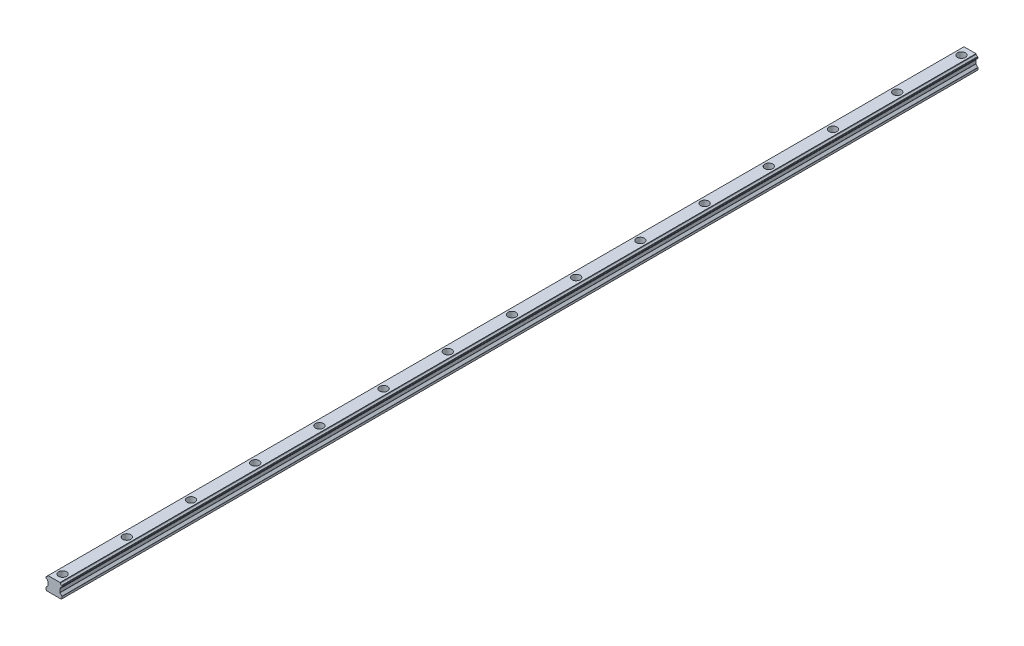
ISO-10303-21;
HEADER;
FILE_DESCRIPTION(('STEP AP214'),'2;1');
FILE_NAME('part.step','',(''),(''),'','','');
FILE_SCHEMA(('AUTOMOTIVE_DESIGN { 1 0 10303 214 1 1 1 1 }'));
ENDSEC;
DATA;
#1=APPLICATION_CONTEXT('core data for automotive mechanical design processes');
#2=APPLICATION_PROTOCOL_DEFINITION('international standard','automotive_design',2000,#1);
#3=PRODUCT_CONTEXT('',#1,'mechanical');
#4=PRODUCT('Part','Part','',(#3));
#5=PRODUCT_RELATED_PRODUCT_CATEGORY('part','',(#4));
#6=PRODUCT_DEFINITION_FORMATION('','',#4);
#7=PRODUCT_DEFINITION_CONTEXT('part definition',#1,'design');
#8=PRODUCT_DEFINITION('design','',#6,#7);
#9=PRODUCT_DEFINITION_SHAPE('','',#8);
#10=(LENGTH_UNIT() NAMED_UNIT(*) SI_UNIT(.MILLI.,.METRE.));
#11=(NAMED_UNIT(*) PLANE_ANGLE_UNIT() SI_UNIT($,.RADIAN.));
#12=(NAMED_UNIT(*) SI_UNIT($,.STERADIAN.) SOLID_ANGLE_UNIT());
#13=UNCERTAINTY_MEASURE_WITH_UNIT(LENGTH_MEASURE(1.E-05),#10,'distance_accuracy_value','');
#14=(GEOMETRIC_REPRESENTATION_CONTEXT(3) GLOBAL_UNCERTAINTY_ASSIGNED_CONTEXT((#13)) GLOBAL_UNIT_ASSIGNED_CONTEXT((#10,
#11,#12)) REPRESENTATION_CONTEXT('',''));
#15=CARTESIAN_POINT('',(0.,0.,0.));
#16=DIRECTION('',(0.,0.,1.));
#17=DIRECTION('',(1.,0.,0.));
#18=AXIS2_PLACEMENT_3D('',#15,#16,#17);
#19=CARTESIAN_POINT('',(7.49999999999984,10.5502160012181,2.22044604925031E-13));
#20=DIRECTION('',(1.,0.,0.));
#21=DIRECTION('',(0.,0.,-1.));
#22=AXIS2_PLACEMENT_3D('',#19,#20,#21);
#23=PLANE('',#22);
#24=DIRECTION('',(0.,1.,0.));
#25=VECTOR('',#24,1.);
#26=CARTESIAN_POINT('',(7.50000000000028,-0.000103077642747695,-856.));
#27=LINE('',#26,#25);
#28=CARTESIAN_POINT('',(7.50000000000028,10.313289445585,-856.));
#29=VERTEX_POINT('',#28);
#30=CARTESIAN_POINT('',(7.50000000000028,10.7871425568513,-856.));
#31=VERTEX_POINT('',#30);
#32=EDGE_CURVE('E816',#29,#31,#27,.T.);
#33=ORIENTED_EDGE('',*,*,#32,.T.);
#34=DIRECTION('',(0.,0.,1.));
#35=VECTOR('',#34,1.);
#36=CARTESIAN_POINT('',(7.49999999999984,10.7871425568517,2.22044604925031E-13));
#37=LINE('',#36,#35);
#38=CARTESIAN_POINT('',(7.49999999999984,10.7871425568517,2.22044604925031E-13));
#39=VERTEX_POINT('',#38);
#40=EDGE_CURVE('E283',#39,#31,#37,.F.);
#41=ORIENTED_EDGE('',*,*,#40,.F.);
#42=DIRECTION('',(0.,1.,0.));
#43=VECTOR('',#42,1.);
#44=CARTESIAN_POINT('',(7.49999999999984,10.5502160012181,2.22044604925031E-13));
#45=LINE('',#44,#43);
#46=CARTESIAN_POINT('',(7.49999999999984,10.3132894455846,2.22044604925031E-13));
#47=VERTEX_POINT('',#46);
#48=EDGE_CURVE('E316',#39,#47,#45,.F.);
#49=ORIENTED_EDGE('',*,*,#48,.T.);
#50=DIRECTION('',(0.,0.,1.));
#51=VECTOR('',#50,1.);
#52=CARTESIAN_POINT('',(7.49999999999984,10.3132894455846,2.22044604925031E-13));
#53=LINE('',#52,#51);
#54=EDGE_CURVE('E35',#29,#47,#53,.T.);
#55=ORIENTED_EDGE('',*,*,#54,.F.);
#56=EDGE_LOOP('',(#33,#41,#49,#55));
#57=FACE_BOUND('',#56,.T.);
#58=ADVANCED_FACE('F32',(#57),#23,.T.);
#59=CARTESIAN_POINT('',(-7.50000000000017,10.5502160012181,2.22044604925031E-13));
#60=DIRECTION('',(-1.,0.,0.));
#61=DIRECTION('',(0.,0.,1.));
#62=AXIS2_PLACEMENT_3D('',#59,#60,#61);
#63=PLANE('',#62);
#64=DIRECTION('',(0.,1.,0.));
#65=VECTOR('',#64,1.);
#66=CARTESIAN_POINT('',(-7.49999999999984,-0.000103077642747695,-856.));
#67=LINE('',#66,#65);
#68=CARTESIAN_POINT('',(-7.49999999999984,10.3132894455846,-856.));
#69=VERTEX_POINT('',#68);
#70=CARTESIAN_POINT('',(-7.49999999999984,10.7871425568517,-856.));
#71=VERTEX_POINT('',#70);
#72=EDGE_CURVE('E853',#69,#71,#67,.T.);
#73=ORIENTED_EDGE('',*,*,#72,.F.);
#74=DIRECTION('',(0.,0.,1.));
#75=VECTOR('',#74,1.);
#76=CARTESIAN_POINT('',(-7.50000000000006,10.3132894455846,2.22044604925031E-13));
#77=LINE('',#76,#75);
#78=CARTESIAN_POINT('',(-7.50000000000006,10.3132894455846,2.22044604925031E-13));
#79=VERTEX_POINT('',#78);
#80=EDGE_CURVE('E308',#79,#69,#77,.F.);
#81=ORIENTED_EDGE('',*,*,#80,.F.);
#82=DIRECTION('',(0.,1.,0.));
#83=VECTOR('',#82,1.);
#84=CARTESIAN_POINT('',(-7.50000000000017,10.5502160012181,2.22044604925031E-13));
#85=LINE('',#84,#83);
#86=CARTESIAN_POINT('',(-7.50000000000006,10.7871425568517,2.22044604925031E-13));
#87=VERTEX_POINT('',#86);
#88=EDGE_CURVE('E301',#79,#87,#85,.T.);
#89=ORIENTED_EDGE('',*,*,#88,.T.);
#90=DIRECTION('',(0.,0.,1.));
#91=VECTOR('',#90,1.);
#92=CARTESIAN_POINT('',(-7.50000000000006,10.7871425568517,2.22044604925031E-13));
#93=LINE('',#92,#91);
#94=EDGE_CURVE('E257',#71,#87,#93,.T.);
#95=ORIENTED_EDGE('',*,*,#94,.F.);
#96=EDGE_LOOP('',(#73,#81,#89,#95));
#97=FACE_BOUND('',#96,.T.);
#98=ADVANCED_FACE('F590',(#97),#63,.T.);
#99=CARTESIAN_POINT('',(5.6517555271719,8.07246279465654,2.22044604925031E-13));
#100=DIRECTION('',(0.707108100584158,-0.707105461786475,0.));
#101=DIRECTION('',(0.707105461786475,0.707108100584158,0.));
#102=AXIS2_PLACEMENT_3D('',#99,#100,#101);
#103=PLANE('',#102);
#104=DIRECTION('',(-0.707105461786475,-0.707108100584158,0.));
#105=VECTOR('',#104,1.);
#106=CARTESIAN_POINT('',(5.65175552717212,8.07246279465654,-856.));
#107=LINE('',#106,#105);
#108=CARTESIAN_POINT('',(5.71564348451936,8.13635099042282,-856.));
#109=VERTEX_POINT('',#108);
#110=CARTESIAN_POINT('',(5.58786756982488,8.00857459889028,-856.));
#111=VERTEX_POINT('',#110);
#112=EDGE_CURVE('E646',#109,#111,#107,.T.);
#113=ORIENTED_EDGE('',*,*,#112,.F.);
#114=DIRECTION('',(0.,0.,-1.));
#115=VECTOR('',#114,1.);
#116=CARTESIAN_POINT('',(5.71564348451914,8.13635099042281,2.22044604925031E-13));
#117=LINE('',#116,#115);
#118=CARTESIAN_POINT('',(5.71564348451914,8.13635099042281,2.22044604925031E-13));
#119=VERTEX_POINT('',#118);
#120=EDGE_CURVE('E290',#119,#109,#117,.T.);
#121=ORIENTED_EDGE('',*,*,#120,.F.);
#122=DIRECTION('',(0.707105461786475,0.707108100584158,0.));
#123=VECTOR('',#122,1.);
#124=CARTESIAN_POINT('',(5.6517555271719,8.07246279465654,2.22044604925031E-13));
#125=LINE('',#124,#123);
#126=CARTESIAN_POINT('',(5.58786756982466,8.00857459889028,2.22044604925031E-13));
#127=VERTEX_POINT('',#126);
#128=EDGE_CURVE('E298',#119,#127,#125,.F.);
#129=ORIENTED_EDGE('',*,*,#128,.T.);
#130=DIRECTION('',(0.,0.,-1.));
#131=VECTOR('',#130,1.);
#132=CARTESIAN_POINT('',(5.58786756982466,8.00857459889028,2.22044604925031E-13));
#133=LINE('',#132,#131);
#134=EDGE_CURVE('E302',#127,#111,#133,.T.);
#135=ORIENTED_EDGE('',*,*,#134,.T.);
#136=EDGE_LOOP('',(#113,#121,#129,#135));
#137=FACE_BOUND('',#136,.T.);
#138=ADVANCED_FACE('F735',(#137),#103,.T.);
#139=CARTESIAN_POINT('',(7.3822757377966,10.0608289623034,2.22044604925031E-13));
#140=DIRECTION('',(0.906307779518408,-0.422618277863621,0.));
#141=DIRECTION('',(0.422618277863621,0.906307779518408,0.));
#142=AXIS2_PLACEMENT_3D('',#139,#140,#141);
#143=PLANE('',#142);
#144=DIRECTION('',(-0.422618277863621,-0.906307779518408,0.));
#145=VECTOR('',#144,1.);
#146=CARTESIAN_POINT('',(7.38227573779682,10.0608289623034,-856.));
#147=LINE('',#146,#145);
#148=CARTESIAN_POINT('',(7.26455147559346,9.80836847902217,-856.));
#149=VERTEX_POINT('',#148);
#150=EDGE_CURVE('E643',#29,#149,#147,.T.);
#151=ORIENTED_EDGE('',*,*,#150,.F.);
#152=ORIENTED_EDGE('',*,*,#54,.T.);
#153=DIRECTION('',(0.422618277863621,0.906307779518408,0.));
#154=VECTOR('',#153,1.);
#155=CARTESIAN_POINT('',(7.3822757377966,10.0608289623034,2.22044604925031E-13));
#156=LINE('',#155,#154);
#157=CARTESIAN_POINT('',(7.26455147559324,9.80836847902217,2.22044604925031E-13));
#158=VERTEX_POINT('',#157);
#159=EDGE_CURVE('E284',#47,#158,#156,.F.);
#160=ORIENTED_EDGE('',*,*,#159,.T.);
#161=DIRECTION('',(0.,0.,-1.));
#162=VECTOR('',#161,1.);
#163=CARTESIAN_POINT('',(7.26455147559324,9.80836847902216,2.22044604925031E-13));
#164=LINE('',#163,#162);
#165=EDGE_CURVE('E287',#149,#158,#164,.F.);
#166=ORIENTED_EDGE('',*,*,#165,.F.);
#167=EDGE_LOOP('',(#151,#152,#160,#166));
#168=FACE_BOUND('',#167,.T.);
#169=ADVANCED_FACE('F812',(#168),#143,.T.);
#170=CARTESIAN_POINT('',(7.38227150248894,11.0396125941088,2.22044604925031E-13));
#171=DIRECTION('',(0.906308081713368,0.422617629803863,0.));
#172=DIRECTION('',(-0.422617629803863,0.906308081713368,0.));
#173=AXIS2_PLACEMENT_3D('',#170,#171,#172);
#174=PLANE('',#173);
#175=DIRECTION('',(0.422617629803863,-0.906308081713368,0.));
#176=VECTOR('',#175,1.);
#177=CARTESIAN_POINT('',(7.38227150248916,11.0396125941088,-856.));
#178=LINE('',#177,#176);
#179=CARTESIAN_POINT('',(7.26454300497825,11.2920826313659,-856.));
#180=VERTEX_POINT('',#179);
#181=EDGE_CURVE('E631',#180,#31,#178,.T.);
#182=ORIENTED_EDGE('',*,*,#181,.F.);
#183=DIRECTION('',(0.,0.,-1.));
#184=VECTOR('',#183,1.);
#185=CARTESIAN_POINT('',(7.26454300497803,11.2920826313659,2.22044604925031E-13));
#186=LINE('',#185,#184);
#187=CARTESIAN_POINT('',(7.26454300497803,11.2920826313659,2.22044604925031E-13));
#188=VERTEX_POINT('',#187);
#189=EDGE_CURVE('E275',#188,#180,#186,.T.);
#190=ORIENTED_EDGE('',*,*,#189,.F.);
#191=DIRECTION('',(-0.422617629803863,0.906308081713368,0.));
#192=VECTOR('',#191,1.);
#193=CARTESIAN_POINT('',(7.38227150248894,11.0396125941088,2.22044604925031E-13));
#194=LINE('',#193,#192);
#195=EDGE_CURVE('E280',#188,#39,#194,.F.);
#196=ORIENTED_EDGE('',*,*,#195,.T.);
#197=ORIENTED_EDGE('',*,*,#40,.T.);
#198=EDGE_LOOP('',(#182,#190,#196,#197));
#199=FACE_BOUND('',#198,.T.);
#200=ADVANCED_FACE('F820',(#199),#174,.T.);
#201=CARTESIAN_POINT('',(-7.38227150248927,11.0396125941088,2.22044604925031E-13));
#202=DIRECTION('',(-0.906308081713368,0.422617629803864,0.));
#203=DIRECTION('',(-0.422617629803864,-0.906308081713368,0.));
#204=AXIS2_PLACEMENT_3D('',#201,#202,#203);
#205=PLANE('',#204);
#206=DIRECTION('',(0.422617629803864,0.906308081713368,0.));
#207=VECTOR('',#206,1.);
#208=CARTESIAN_POINT('',(-7.38227150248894,11.0396125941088,-856.));
#209=LINE('',#208,#207);
#210=CARTESIAN_POINT('',(-7.26454300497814,11.2920826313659,-856.));
#211=VERTEX_POINT('',#210);
#212=EDGE_CURVE('E586',#71,#211,#209,.T.);
#213=ORIENTED_EDGE('',*,*,#212,.F.);
#214=ORIENTED_EDGE('',*,*,#94,.T.);
#215=DIRECTION('',(-0.422617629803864,-0.906308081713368,0.));
#216=VECTOR('',#215,1.);
#217=CARTESIAN_POINT('',(-7.38227150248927,11.0396125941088,2.22044604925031E-13));
#218=LINE('',#217,#216);
#219=CARTESIAN_POINT('',(-7.26454300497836,11.2920826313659,2.22044604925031E-13));
#220=VERTEX_POINT('',#219);
#221=EDGE_CURVE('E573',#87,#220,#218,.F.);
#222=ORIENTED_EDGE('',*,*,#221,.T.);
#223=DIRECTION('',(0.,0.,-1.));
#224=VECTOR('',#223,1.);
#225=CARTESIAN_POINT('',(-7.26454300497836,11.2920826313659,2.22044604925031E-13));
#226=LINE('',#225,#224);
#227=EDGE_CURVE('E531',#211,#220,#226,.F.);
#228=ORIENTED_EDGE('',*,*,#227,.F.);
#229=EDGE_LOOP('',(#213,#214,#222,#228));
#230=FACE_BOUND('',#229,.T.);
#231=ADVANCED_FACE('F583',(#230),#205,.T.);
#232=CARTESIAN_POINT('',(-7.38227573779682,10.0608289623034,2.22044604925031E-13));
#233=DIRECTION('',(-0.906307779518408,-0.422618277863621,0.));
#234=DIRECTION('',(0.422618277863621,-0.906307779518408,0.));
#235=AXIS2_PLACEMENT_3D('',#232,#233,#234);
#236=PLANE('',#235);
#237=DIRECTION('',(-0.422618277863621,0.906307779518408,0.));
#238=VECTOR('',#237,1.);
#239=CARTESIAN_POINT('',(-7.3822757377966,10.0608289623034,-856.));
#240=LINE('',#239,#238);
#241=CARTESIAN_POINT('',(-7.26455147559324,9.80836847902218,-856.));
#242=VERTEX_POINT('',#241);
#243=EDGE_CURVE('E855',#242,#69,#240,.T.);
#244=ORIENTED_EDGE('',*,*,#243,.F.);
#245=DIRECTION('',(0.,0.,-1.));
#246=VECTOR('',#245,1.);
#247=CARTESIAN_POINT('',(-7.26455147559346,9.80836847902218,2.22044604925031E-13));
#248=LINE('',#247,#246);
#249=CARTESIAN_POINT('',(-7.26455147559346,9.80836847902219,2.22044604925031E-13));
#250=VERTEX_POINT('',#249);
#251=EDGE_CURVE('E528',#250,#242,#248,.T.);
#252=ORIENTED_EDGE('',*,*,#251,.F.);
#253=DIRECTION('',(0.422618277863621,-0.906307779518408,0.));
#254=VECTOR('',#253,1.);
#255=CARTESIAN_POINT('',(-7.38227573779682,10.0608289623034,2.22044604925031E-13));
#256=LINE('',#255,#254);
#257=EDGE_CURVE('E311',#250,#79,#256,.F.);
#258=ORIENTED_EDGE('',*,*,#257,.T.);
#259=ORIENTED_EDGE('',*,*,#80,.T.);
#260=EDGE_LOOP('',(#244,#252,#258,#259));
#261=FACE_BOUND('',#260,.T.);
#262=ADVANCED_FACE('F1103',(#261),#236,.T.);
#263=CARTESIAN_POINT('',(-5.65175552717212,8.07246279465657,2.22044604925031E-13));
#264=DIRECTION('',(-0.707108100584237,-0.707105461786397,0.));
#265=DIRECTION('',(0.707105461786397,-0.707108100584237,0.));
#266=AXIS2_PLACEMENT_3D('',#263,#264,#265);
#267=PLANE('',#266);
#268=DIRECTION('',(-0.707105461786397,0.707108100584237,0.));
#269=VECTOR('',#268,1.);
#270=CARTESIAN_POINT('',(-5.6517555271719,8.07246279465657,-856.));
#271=LINE('',#270,#269);
#272=CARTESIAN_POINT('',(-5.58786756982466,8.00857459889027,-856.));
#273=VERTEX_POINT('',#272);
#274=CARTESIAN_POINT('',(-5.71564348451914,8.13635099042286,-856.));
#275=VERTEX_POINT('',#274);
#276=EDGE_CURVE('E869',#273,#275,#271,.T.);
#277=ORIENTED_EDGE('',*,*,#276,.F.);
#278=DIRECTION('',(0.,0.,-1.));
#279=VECTOR('',#278,1.);
#280=CARTESIAN_POINT('',(-5.58786756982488,8.00857459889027,2.22044604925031E-13));
#281=LINE('',#280,#279);
#282=CARTESIAN_POINT('',(-5.58786756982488,8.00857459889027,2.22044604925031E-13));
#283=VERTEX_POINT('',#282);
#284=EDGE_CURVE('E179',#273,#283,#281,.F.);
#285=ORIENTED_EDGE('',*,*,#284,.T.);
#286=DIRECTION('',(0.707105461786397,-0.707108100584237,0.));
#287=VECTOR('',#286,1.);
#288=CARTESIAN_POINT('',(-5.65175552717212,8.07246279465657,2.22044604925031E-13));
#289=LINE('',#288,#287);
#290=CARTESIAN_POINT('',(-5.71564348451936,8.13635099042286,2.22044604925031E-13));
#291=VERTEX_POINT('',#290);
#292=EDGE_CURVE('E175',#283,#291,#289,.F.);
#293=ORIENTED_EDGE('',*,*,#292,.T.);
#294=DIRECTION('',(0.,0.,-1.));
#295=VECTOR('',#294,1.);
#296=CARTESIAN_POINT('',(-5.71564348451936,8.13635099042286,2.22044604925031E-13));
#297=LINE('',#296,#295);
#298=EDGE_CURVE('E524',#275,#291,#297,.F.);
#299=ORIENTED_EDGE('',*,*,#298,.F.);
#300=EDGE_LOOP('',(#277,#285,#293,#299));
#301=FACE_BOUND('',#300,.T.);
#302=ADVANCED_FACE('F1100',(#301),#267,.T.);
#303=CARTESIAN_POINT('',(-5.80000000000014,7.79644296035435,2.22044604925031E-13));
#304=DIRECTION('',(0.,0.,-1.));
#305=DIRECTION('',(-1.,0.,0.));
#306=AXIS2_PLACEMENT_3D('',#303,#304,#305);
#307=CYLINDRICAL_SURFACE('',#306,0.3);
#308=ORIENTED_EDGE('',*,*,#284,.F.);
#309=CARTESIAN_POINT('',(-5.79999999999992,7.79644296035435,-856.));
#310=DIRECTION('',(0.,0.,1.));
#311=DIRECTION('',(1.,0.,0.));
#312=AXIS2_PLACEMENT_3D('',#309,#310,#311);
#313=CIRCLE('',#312,0.3);
#314=CARTESIAN_POINT('',(-5.49999999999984,7.79644296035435,-856.));
#315=VERTEX_POINT('',#314);
#316=EDGE_CURVE('E187',#273,#315,#313,.F.);
#317=ORIENTED_EDGE('',*,*,#316,.T.);
#318=DIRECTION('',(0.,0.,1.));
#319=VECTOR('',#318,1.);
#320=CARTESIAN_POINT('',(-5.50000000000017,7.79644296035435,2.22044604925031E-13));
#321=LINE('',#320,#319);
#322=CARTESIAN_POINT('',(-5.50000000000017,7.79644296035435,2.22044604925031E-13));
#323=VERTEX_POINT('',#322);
#324=EDGE_CURVE('E183',#323,#315,#321,.F.);
#325=ORIENTED_EDGE('',*,*,#324,.F.);
#326=CARTESIAN_POINT('',(-5.80000000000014,7.79644296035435,2.22044604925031E-13));
#327=DIRECTION('',(0.,0.,-1.));
#328=DIRECTION('',(-1.,0.,0.));
#329=AXIS2_PLACEMENT_3D('',#326,#327,#328);
#330=CIRCLE('',#329,0.3);
#331=EDGE_CURVE('E167',#283,#323,#330,.T.);
#332=ORIENTED_EDGE('',*,*,#331,.F.);
#333=EDGE_LOOP('',(#308,#317,#325,#332));
#334=FACE_BOUND('',#333,.T.);
#335=ADVANCED_FACE('F184',(#334),#307,.F.);
#336=CARTESIAN_POINT('',(-5.80000000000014,4.82426415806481,2.22044604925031E-13));
#337=DIRECTION('',(0.,0.,-1.));
#338=DIRECTION('',(-1.,0.,0.));
#339=AXIS2_PLACEMENT_3D('',#336,#337,#338);
#340=CYLINDRICAL_SURFACE('',#339,0.3);
#341=DIRECTION('',(0.,0.,1.));
#342=VECTOR('',#341,1.);
#343=CARTESIAN_POINT('',(-5.50000000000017,4.82426415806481,2.22044604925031E-13));
#344=LINE('',#343,#342);
#345=CARTESIAN_POINT('',(-5.49999999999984,4.82426415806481,-856.));
#346=VERTEX_POINT('',#345);
#347=CARTESIAN_POINT('',(-5.50000000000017,4.82426415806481,2.22044604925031E-13));
#348=VERTEX_POINT('',#347);
#349=EDGE_CURVE('E191',#346,#348,#344,.T.);
#350=ORIENTED_EDGE('',*,*,#349,.F.);
#351=CARTESIAN_POINT('',(-5.79999999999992,4.82426415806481,-856.));
#352=DIRECTION('',(0.,0.,1.));
#353=DIRECTION('',(1.,0.,0.));
#354=AXIS2_PLACEMENT_3D('',#351,#352,#353);
#355=CIRCLE('',#354,0.3);
#356=CARTESIAN_POINT('',(-5.58786796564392,4.61213212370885,-856.));
#357=VERTEX_POINT('',#356);
#358=EDGE_CURVE('E875',#346,#357,#355,.F.);
#359=ORIENTED_EDGE('',*,*,#358,.T.);
#360=DIRECTION('',(0.,0.,1.));
#361=VECTOR('',#360,1.);
#362=CARTESIAN_POINT('',(-5.58786796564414,4.61213212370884,2.22044604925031E-13));
#363=LINE('',#362,#361);
#364=CARTESIAN_POINT('',(-5.58786796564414,4.61213212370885,2.22044604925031E-13));
#365=VERTEX_POINT('',#364);
#366=EDGE_CURVE('E241',#365,#357,#363,.F.);
#367=ORIENTED_EDGE('',*,*,#366,.F.);
#368=CARTESIAN_POINT('',(-5.80000000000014,4.82426415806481,2.22044604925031E-13));
#369=DIRECTION('',(0.,0.,-1.));
#370=DIRECTION('',(-1.,0.,0.));
#371=AXIS2_PLACEMENT_3D('',#368,#369,#370);
#372=CIRCLE('',#371,0.3);
#373=EDGE_CURVE('E178',#348,#365,#372,.T.);
#374=ORIENTED_EDGE('',*,*,#373,.F.);
#375=EDGE_LOOP('',(#350,#359,#367,#374));
#376=FACE_BOUND('',#375,.T.);
#377=ADVANCED_FACE('F883',(#376),#340,.F.);
#378=CARTESIAN_POINT('',(7.19999999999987,2.57573602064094,0.));
#379=DIRECTION('',(0.,0.,-1.));
#380=DIRECTION('',(-1.,0.,0.));
#381=AXIS2_PLACEMENT_3D('',#378,#379,#380);
#382=CYLINDRICAL_SURFACE('',#381,0.3);
#383=CARTESIAN_POINT('',(7.2000000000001,2.57573602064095,-856.));
#384=DIRECTION('',(0.,0.,1.));
#385=DIRECTION('',(1.,0.,0.));
#386=AXIS2_PLACEMENT_3D('',#383,#384,#385);
#387=CIRCLE('',#386,0.3);
#388=CARTESIAN_POINT('',(7.41213203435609,2.78786805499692,-856.));
#389=VERTEX_POINT('',#388);
#390=CARTESIAN_POINT('',(7.50000000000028,2.57573602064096,-856.));
#391=VERTEX_POINT('',#390);
#392=EDGE_CURVE('E326',#389,#391,#387,.F.);
#393=ORIENTED_EDGE('',*,*,#392,.F.);
#394=DIRECTION('',(0.,0.,1.));
#395=VECTOR('',#394,1.);
#396=CARTESIAN_POINT('',(7.41213203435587,2.78786805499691,0.));
#397=LINE('',#396,#395);
#398=CARTESIAN_POINT('',(7.41213203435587,2.78786805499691,0.));
#399=VERTEX_POINT('',#398);
#400=EDGE_CURVE('E234',#399,#389,#397,.F.);
#401=ORIENTED_EDGE('',*,*,#400,.F.);
#402=CARTESIAN_POINT('',(7.19999999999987,2.57573602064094,0.));
#403=DIRECTION('',(0.,0.,-1.));
#404=DIRECTION('',(-1.,0.,0.));
#405=AXIS2_PLACEMENT_3D('',#402,#403,#404);
#406=CIRCLE('',#405,0.3);
#407=CARTESIAN_POINT('',(7.49999999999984,2.57573602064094,0.));
#408=VERTEX_POINT('',#407);
#409=EDGE_CURVE('E539',#399,#408,#406,.T.);
#410=ORIENTED_EDGE('',*,*,#409,.T.);
#411=DIRECTION('',(0.,0.,1.));
#412=VECTOR('',#411,1.);
#413=CARTESIAN_POINT('',(7.49999999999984,2.57573602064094,0.));
#414=LINE('',#413,#412);
#415=EDGE_CURVE('E239',#391,#408,#414,.T.);
#416=ORIENTED_EDGE('',*,*,#415,.F.);
#417=EDGE_LOOP('',(#393,#401,#410,#416));
#418=FACE_BOUND('',#417,.T.);
#419=ADVANCED_FACE('F710',(#418),#382,.T.);
#420=CARTESIAN_POINT('',(5.79999999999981,7.79644296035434,2.22044604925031E-13));
#421=DIRECTION('',(0.,0.,-1.));
#422=DIRECTION('',(-1.,0.,0.));
#423=AXIS2_PLACEMENT_3D('',#420,#421,#422);
#424=CYLINDRICAL_SURFACE('',#423,0.3);
#425=DIRECTION('',(0.,0.,1.));
#426=VECTOR('',#425,1.);
#427=CARTESIAN_POINT('',(5.49999999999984,7.79644296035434,2.22044604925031E-13));
#428=LINE('',#427,#426);
#429=CARTESIAN_POINT('',(5.50000000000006,7.79644296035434,-856.));
#430=VERTEX_POINT('',#429);
#431=CARTESIAN_POINT('',(5.49999999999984,7.79644296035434,2.22044604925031E-13));
#432=VERTEX_POINT('',#431);
#433=EDGE_CURVE('E232',#430,#432,#428,.T.);
#434=ORIENTED_EDGE('',*,*,#433,.F.);
#435=CARTESIAN_POINT('',(5.80000000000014,7.79644296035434,-856.));
#436=DIRECTION('',(0.,0.,1.));
#437=DIRECTION('',(1.,0.,0.));
#438=AXIS2_PLACEMENT_3D('',#435,#436,#437);
#439=CIRCLE('',#438,0.3);
#440=EDGE_CURVE('E649',#430,#111,#439,.F.);
#441=ORIENTED_EDGE('',*,*,#440,.T.);
#442=ORIENTED_EDGE('',*,*,#134,.F.);
#443=CARTESIAN_POINT('',(5.79999999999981,7.79644296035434,2.22044604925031E-13));
#444=DIRECTION('',(0.,0.,-1.));
#445=DIRECTION('',(-1.,0.,0.));
#446=AXIS2_PLACEMENT_3D('',#443,#444,#445);
#447=CIRCLE('',#446,0.3);
#448=EDGE_CURVE('E306',#432,#127,#447,.T.);
#449=ORIENTED_EDGE('',*,*,#448,.F.);
#450=EDGE_LOOP('',(#434,#441,#442,#449));
#451=FACE_BOUND('',#450,.T.);
#452=ADVANCED_FACE('F737',(#451),#424,.F.);
#453=CARTESIAN_POINT('',(5.79999999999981,4.8242641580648,2.22044604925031E-13));
#454=DIRECTION('',(0.,0.,-1.));
#455=DIRECTION('',(-1.,0.,0.));
#456=AXIS2_PLACEMENT_3D('',#453,#454,#455);
#457=CYLINDRICAL_SURFACE('',#456,0.3);
#458=DIRECTION('',(0.,0.,1.));
#459=VECTOR('',#458,1.);
#460=CARTESIAN_POINT('',(5.58786796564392,4.61213212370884,2.22044604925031E-13));
#461=LINE('',#460,#459);
#462=CARTESIAN_POINT('',(5.58786796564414,4.61213212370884,-856.));
#463=VERTEX_POINT('',#462);
#464=CARTESIAN_POINT('',(5.58786796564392,4.61213212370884,2.22044604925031E-13));
#465=VERTEX_POINT('',#464);
#466=EDGE_CURVE('E237',#463,#465,#461,.T.);
#467=ORIENTED_EDGE('',*,*,#466,.F.);
#468=CARTESIAN_POINT('',(5.80000000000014,4.8242641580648,-856.));
#469=DIRECTION('',(0.,0.,1.));
#470=DIRECTION('',(1.,0.,0.));
#471=AXIS2_PLACEMENT_3D('',#468,#469,#470);
#472=CIRCLE('',#471,0.3);
#473=CARTESIAN_POINT('',(5.50000000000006,4.8242641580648,-856.));
#474=VERTEX_POINT('',#473);
#475=EDGE_CURVE('E655',#463,#474,#472,.F.);
#476=ORIENTED_EDGE('',*,*,#475,.T.);
#477=DIRECTION('',(0.,0.,1.));
#478=VECTOR('',#477,1.);
#479=CARTESIAN_POINT('',(5.49999999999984,4.8242641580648,2.22044604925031E-13));
#480=LINE('',#479,#478);
#481=CARTESIAN_POINT('',(5.49999999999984,4.8242641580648,2.22044604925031E-13));
#482=VERTEX_POINT('',#481);
#483=EDGE_CURVE('E227',#482,#474,#480,.F.);
#484=ORIENTED_EDGE('',*,*,#483,.F.);
#485=CARTESIAN_POINT('',(5.79999999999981,4.8242641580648,2.22044604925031E-13));
#486=DIRECTION('',(0.,0.,-1.));
#487=DIRECTION('',(-1.,0.,0.));
#488=AXIS2_PLACEMENT_3D('',#485,#486,#487);
#489=CIRCLE('',#488,0.3);
#490=EDGE_CURVE('E305',#465,#482,#489,.T.);
#491=ORIENTED_EDGE('',*,*,#490,.F.);
#492=EDGE_LOOP('',(#467,#476,#484,#491));
#493=FACE_BOUND('',#492,.T.);
#494=ADVANCED_FACE('F720',(#493),#457,.F.);
#495=CARTESIAN_POINT('',(5.50351105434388,8.34848262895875,2.22044604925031E-13));
#496=DIRECTION('',(0.,0.,-1.));
#497=DIRECTION('',(-1.,0.,0.));
#498=AXIS2_PLACEMENT_3D('',#495,#496,#497);
#499=CYLINDRICAL_SURFACE('',#498,0.3);
#500=CARTESIAN_POINT('',(5.5035110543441,8.34848262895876,-856.));
#501=DIRECTION('',(0.,0.,1.));
#502=DIRECTION('',(1.,0.,0.));
#503=AXIS2_PLACEMENT_3D('',#500,#501,#502);
#504=CIRCLE('',#503,0.3);
#505=CARTESIAN_POINT('',(5.80269299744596,8.32634296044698,-856.));
#506=VERTEX_POINT('',#505);
#507=EDGE_CURVE('E640',#506,#109,#504,.F.);
#508=ORIENTED_EDGE('',*,*,#507,.F.);
#509=DIRECTION('',(0.,0.,-1.));
#510=VECTOR('',#509,1.);
#511=CARTESIAN_POINT('',(5.80269299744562,8.32634296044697,2.22044604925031E-13));
#512=LINE('',#511,#510);
#513=CARTESIAN_POINT('',(5.80269299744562,8.32634296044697,2.22044604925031E-13));
#514=VERTEX_POINT('',#513);
#515=EDGE_CURVE('E225',#506,#514,#512,.F.);
#516=ORIENTED_EDGE('',*,*,#515,.T.);
#517=CARTESIAN_POINT('',(5.50351105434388,8.34848262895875,2.22044604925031E-13));
#518=DIRECTION('',(0.,0.,-1.));
#519=DIRECTION('',(-1.,0.,0.));
#520=AXIS2_PLACEMENT_3D('',#517,#518,#519);
#521=CIRCLE('',#520,0.3);
#522=EDGE_CURVE('E297',#514,#119,#521,.T.);
#523=ORIENTED_EDGE('',*,*,#522,.T.);
#524=ORIENTED_EDGE('',*,*,#120,.T.);
#525=EDGE_LOOP('',(#508,#516,#523,#524));
#526=FACE_BOUND('',#525,.T.);
#527=ADVANCED_FACE('F798',(#526),#499,.T.);
#528=CARTESIAN_POINT('',(6.99265914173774,9.93515396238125,2.22044604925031E-13));
#529=DIRECTION('',(0.,0.,-1.));
#530=DIRECTION('',(-1.,0.,0.));
#531=AXIS2_PLACEMENT_3D('',#528,#529,#530);
#532=CYLINDRICAL_SURFACE('',#531,0.3);
#533=CARTESIAN_POINT('',(6.99265914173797,9.93515396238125,-856.));
#534=DIRECTION('',(0.,0.,1.));
#535=DIRECTION('',(1.,0.,0.));
#536=AXIS2_PLACEMENT_3D('',#533,#534,#535);
#537=CIRCLE('',#536,0.3);
#538=CARTESIAN_POINT('',(7.03370726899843,9.63797547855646,-856.));
#539=VERTEX_POINT('',#538);
#540=EDGE_CURVE('E637',#149,#539,#537,.F.);
#541=ORIENTED_EDGE('',*,*,#540,.F.);
#542=ORIENTED_EDGE('',*,*,#165,.T.);
#543=CARTESIAN_POINT('',(6.99265914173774,9.93515396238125,2.22044604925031E-13));
#544=DIRECTION('',(0.,0.,-1.));
#545=DIRECTION('',(-1.,0.,0.));
#546=AXIS2_PLACEMENT_3D('',#543,#544,#545);
#547=CIRCLE('',#546,0.3);
#548=CARTESIAN_POINT('',(7.03370726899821,9.63797547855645,2.22044604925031E-13));
#549=VERTEX_POINT('',#548);
#550=EDGE_CURVE('E289',#158,#549,#547,.T.);
#551=ORIENTED_EDGE('',*,*,#550,.T.);
#552=DIRECTION('',(0.,0.,-1.));
#553=VECTOR('',#552,1.);
#554=CARTESIAN_POINT('',(7.03370726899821,9.63797547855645,2.22044604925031E-13));
#555=LINE('',#554,#553);
#556=EDGE_CURVE('E221',#549,#539,#555,.T.);
#557=ORIENTED_EDGE('',*,*,#556,.T.);
#558=EDGE_LOOP('',(#541,#542,#551,#557));
#559=FACE_BOUND('',#558,.T.);
#560=ADVANCED_FACE('F806',(#559),#532,.T.);
#561=CARTESIAN_POINT('',(6.99265058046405,11.1652973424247,2.22044604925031E-13));
#562=DIRECTION('',(0.,0.,-1.));
#563=DIRECTION('',(-1.,0.,0.));
#564=AXIS2_PLACEMENT_3D('',#561,#562,#563);
#565=CYLINDRICAL_SURFACE('',#564,0.3);
#566=CARTESIAN_POINT('',(6.99265058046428,11.1652973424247,-856.));
#567=DIRECTION('',(0.,0.,1.));
#568=DIRECTION('',(1.,0.,0.));
#569=AXIS2_PLACEMENT_3D('',#566,#567,#568);
#570=CIRCLE('',#569,0.3);
#571=CARTESIAN_POINT('',(7.03370019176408,11.4624756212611,-856.));
#572=VERTEX_POINT('',#571);
#573=EDGE_CURVE('E628',#572,#180,#570,.F.);
#574=ORIENTED_EDGE('',*,*,#573,.F.);
#575=DIRECTION('',(0.,0.,-1.));
#576=VECTOR('',#575,1.);
#577=CARTESIAN_POINT('',(7.03370019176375,11.4624756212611,2.22044604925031E-13));
#578=LINE('',#577,#576);
#579=CARTESIAN_POINT('',(7.03370019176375,11.4624756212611,2.22044604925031E-13));
#580=VERTEX_POINT('',#579);
#581=EDGE_CURVE('E218',#572,#580,#578,.F.);
#582=ORIENTED_EDGE('',*,*,#581,.T.);
#583=CARTESIAN_POINT('',(6.99265058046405,11.1652973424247,2.22044604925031E-13));
#584=DIRECTION('',(0.,0.,-1.));
#585=DIRECTION('',(-1.,0.,0.));
#586=AXIS2_PLACEMENT_3D('',#583,#584,#585);
#587=CIRCLE('',#586,0.3);
#588=EDGE_CURVE('E279',#580,#188,#587,.T.);
#589=ORIENTED_EDGE('',*,*,#588,.T.);
#590=ORIENTED_EDGE('',*,*,#189,.T.);
#591=EDGE_LOOP('',(#574,#582,#589,#590));
#592=FACE_BOUND('',#591,.T.);
#593=ADVANCED_FACE('F1077',(#592),#565,.T.);
#594=CARTESIAN_POINT('',(2.22044604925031E-13,10.5,-848.));
#595=DIRECTION('',(0.,-1.,0.));
#596=DIRECTION('',(0.,0.,-1.));
#597=AXIS2_PLACEMENT_3D('',#594,#595,#596);
#598=CYLINDRICAL_SURFACE('',#597,3.75);
#599=CARTESIAN_POINT('',(2.22044604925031E-13,7.,-848.));
#600=DIRECTION('',(0.,-1.,0.));
#601=DIRECTION('',(0.,0.,-1.));
#602=AXIS2_PLACEMENT_3D('',#599,#600,#601);
#603=CIRCLE('',#602,3.75);
#604=CARTESIAN_POINT('',(2.22044604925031E-13,7.,-851.75));
#605=VERTEX_POINT('',#604);
#606=EDGE_CURVE('E516',#605,#605,#603,.T.);
#607=ORIENTED_EDGE('',*,*,#606,.T.);
#608=EDGE_LOOP('',(#607));
#609=FACE_BOUND('',#608,.T.);
#610=CARTESIAN_POINT('',(2.22044604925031E-13,13.0000045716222,-848.));
#611=DIRECTION('',(0.,-1.,0.));
#612=DIRECTION('',(0.,0.,-1.));
#613=AXIS2_PLACEMENT_3D('',#610,#611,#612);
#614=CIRCLE('',#613,3.75);
#615=CARTESIAN_POINT('',(2.22044604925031E-13,13.0000045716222,-851.75));
#616=VERTEX_POINT('',#615);
#617=EDGE_CURVE('E224',#616,#616,#614,.T.);
#618=ORIENTED_EDGE('',*,*,#617,.F.);
#619=EDGE_LOOP('',(#618));
#620=FACE_BOUND('',#619,.T.);
#621=ADVANCED_FACE('F1069',(#609,#620),#598,.F.);
#622=CARTESIAN_POINT('',(0.,10.5,-788.));
#623=DIRECTION('',(0.,-1.,0.));
#624=DIRECTION('',(0.,0.,-1.));
#625=AXIS2_PLACEMENT_3D('',#622,#623,#624);
#626=CYLINDRICAL_SURFACE('',#625,3.75);
#627=CARTESIAN_POINT('',(0.,6.99999999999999,-788.));
#628=DIRECTION('',(0.,-1.,0.));
#629=DIRECTION('',(0.,0.,-1.));
#630=AXIS2_PLACEMENT_3D('',#627,#628,#629);
#631=CIRCLE('',#630,3.75);
#632=CARTESIAN_POINT('',(0.,6.99999999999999,-791.75));
#633=VERTEX_POINT('',#632);
#634=EDGE_CURVE('E513',#633,#633,#631,.T.);
#635=ORIENTED_EDGE('',*,*,#634,.T.);
#636=EDGE_LOOP('',(#635));
#637=FACE_BOUND('',#636,.T.);
#638=CARTESIAN_POINT('',(0.,13.0000045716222,-788.));
#639=DIRECTION('',(0.,-1.,0.));
#640=DIRECTION('',(0.,0.,-1.));
#641=AXIS2_PLACEMENT_3D('',#638,#639,#640);
#642=CIRCLE('',#641,3.75);
#643=CARTESIAN_POINT('',(0.,13.0000045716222,-791.75));
#644=VERTEX_POINT('',#643);
#645=EDGE_CURVE('E469',#644,#644,#642,.T.);
#646=ORIENTED_EDGE('',*,*,#645,.F.);
#647=EDGE_LOOP('',(#646));
#648=FACE_BOUND('',#647,.T.);
#649=ADVANCED_FACE('F1065',(#637,#648),#626,.F.);
#650=CARTESIAN_POINT('',(0.,10.5,-728.));
#651=DIRECTION('',(0.,-1.,0.));
#652=DIRECTION('',(0.,0.,-1.));
#653=AXIS2_PLACEMENT_3D('',#650,#651,#652);
#654=CYLINDRICAL_SURFACE('',#653,3.75);
#655=CARTESIAN_POINT('',(0.,6.99999999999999,-728.));
#656=DIRECTION('',(0.,-1.,0.));
#657=DIRECTION('',(0.,0.,-1.));
#658=AXIS2_PLACEMENT_3D('',#655,#656,#657);
#659=CIRCLE('',#658,3.75);
#660=CARTESIAN_POINT('',(0.,6.99999999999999,-731.75));
#661=VERTEX_POINT('',#660);
#662=EDGE_CURVE('E510',#661,#661,#659,.T.);
#663=ORIENTED_EDGE('',*,*,#662,.T.);
#664=EDGE_LOOP('',(#663));
#665=FACE_BOUND('',#664,.T.);
#666=CARTESIAN_POINT('',(0.,13.0000045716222,-728.));
#667=DIRECTION('',(0.,-1.,0.));
#668=DIRECTION('',(0.,0.,-1.));
#669=AXIS2_PLACEMENT_3D('',#666,#667,#668);
#670=CIRCLE('',#669,3.75);
#671=CARTESIAN_POINT('',(0.,13.0000045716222,-731.75));
#672=VERTEX_POINT('',#671);
#673=EDGE_CURVE('E466',#672,#672,#670,.T.);
#674=ORIENTED_EDGE('',*,*,#673,.F.);
#675=EDGE_LOOP('',(#674));
#676=FACE_BOUND('',#675,.T.);
#677=ADVANCED_FACE('F1068',(#665,#676),#654,.F.);
#678=CARTESIAN_POINT('',(0.,10.5,-668.));
#679=DIRECTION('',(0.,-1.,0.));
#680=DIRECTION('',(0.,0.,-1.));
#681=AXIS2_PLACEMENT_3D('',#678,#679,#680);
#682=CYLINDRICAL_SURFACE('',#681,3.75);
#683=CARTESIAN_POINT('',(0.,7.,-668.));
#684=DIRECTION('',(0.,-1.,0.));
#685=DIRECTION('',(0.,0.,-1.));
#686=AXIS2_PLACEMENT_3D('',#683,#684,#685);
#687=CIRCLE('',#686,3.75);
#688=CARTESIAN_POINT('',(0.,7.,-671.75));
#689=VERTEX_POINT('',#688);
#690=EDGE_CURVE('E507',#689,#689,#687,.T.);
#691=ORIENTED_EDGE('',*,*,#690,.T.);
#692=EDGE_LOOP('',(#691));
#693=FACE_BOUND('',#692,.T.);
#694=CARTESIAN_POINT('',(0.,13.0000045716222,-668.));
#695=DIRECTION('',(0.,-1.,0.));
#696=DIRECTION('',(0.,0.,-1.));
#697=AXIS2_PLACEMENT_3D('',#694,#695,#696);
#698=CIRCLE('',#697,3.75);
#699=CARTESIAN_POINT('',(0.,13.0000045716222,-671.75));
#700=VERTEX_POINT('',#699);
#701=EDGE_CURVE('E463',#700,#700,#698,.T.);
#702=ORIENTED_EDGE('',*,*,#701,.F.);
#703=EDGE_LOOP('',(#702));
#704=FACE_BOUND('',#703,.T.);
#705=ADVANCED_FACE('F1247',(#693,#704),#682,.F.);
#706=CARTESIAN_POINT('',(2.22044604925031E-13,10.5,-608.));
#707=DIRECTION('',(0.,-1.,0.));
#708=DIRECTION('',(0.,0.,-1.));
#709=AXIS2_PLACEMENT_3D('',#706,#707,#708);
#710=CYLINDRICAL_SURFACE('',#709,3.75);
#711=CARTESIAN_POINT('',(2.22044604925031E-13,6.99999999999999,-608.));
#712=DIRECTION('',(0.,-1.,0.));
#713=DIRECTION('',(0.,0.,-1.));
#714=AXIS2_PLACEMENT_3D('',#711,#712,#713);
#715=CIRCLE('',#714,3.75);
#716=CARTESIAN_POINT('',(2.22044604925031E-13,6.99999999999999,-611.75));
#717=VERTEX_POINT('',#716);
#718=EDGE_CURVE('E504',#717,#717,#715,.T.);
#719=ORIENTED_EDGE('',*,*,#718,.T.);
#720=EDGE_LOOP('',(#719));
#721=FACE_BOUND('',#720,.T.);
#722=CARTESIAN_POINT('',(2.22044604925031E-13,13.0000045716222,-608.));
#723=DIRECTION('',(0.,-1.,0.));
#724=DIRECTION('',(0.,0.,-1.));
#725=AXIS2_PLACEMENT_3D('',#722,#723,#724);
#726=CIRCLE('',#725,3.75);
#727=CARTESIAN_POINT('',(2.22044604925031E-13,13.0000045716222,-611.75));
#728=VERTEX_POINT('',#727);
#729=EDGE_CURVE('E460',#728,#728,#726,.T.);
#730=ORIENTED_EDGE('',*,*,#729,.F.);
#731=EDGE_LOOP('',(#730));
#732=FACE_BOUND('',#731,.T.);
#733=ADVANCED_FACE('F1257',(#721,#732),#710,.F.);
#734=CARTESIAN_POINT('',(0.,10.5,-548.));
#735=DIRECTION('',(0.,-1.,0.));
#736=DIRECTION('',(0.,0.,-1.));
#737=AXIS2_PLACEMENT_3D('',#734,#735,#736);
#738=CYLINDRICAL_SURFACE('',#737,3.75);
#739=CARTESIAN_POINT('',(0.,6.99999999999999,-548.));
#740=DIRECTION('',(0.,-1.,0.));
#741=DIRECTION('',(0.,0.,-1.));
#742=AXIS2_PLACEMENT_3D('',#739,#740,#741);
#743=CIRCLE('',#742,3.75);
#744=CARTESIAN_POINT('',(0.,6.99999999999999,-551.75));
#745=VERTEX_POINT('',#744);
#746=EDGE_CURVE('E501',#745,#745,#743,.T.);
#747=ORIENTED_EDGE('',*,*,#746,.T.);
#748=EDGE_LOOP('',(#747));
#749=FACE_BOUND('',#748,.T.);
#750=CARTESIAN_POINT('',(0.,13.0000045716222,-548.));
#751=DIRECTION('',(0.,-1.,0.));
#752=DIRECTION('',(0.,0.,-1.));
#753=AXIS2_PLACEMENT_3D('',#750,#751,#752);
#754=CIRCLE('',#753,3.75);
#755=CARTESIAN_POINT('',(0.,13.0000045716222,-551.75));
#756=VERTEX_POINT('',#755);
#757=EDGE_CURVE('E457',#756,#756,#754,.T.);
#758=ORIENTED_EDGE('',*,*,#757,.F.);
#759=EDGE_LOOP('',(#758));
#760=FACE_BOUND('',#759,.T.);
#761=ADVANCED_FACE('F1268',(#749,#760),#738,.F.);
#762=CARTESIAN_POINT('',(0.,10.5,-488.));
#763=DIRECTION('',(0.,-1.,0.));
#764=DIRECTION('',(0.,0.,-1.));
#765=AXIS2_PLACEMENT_3D('',#762,#763,#764);
#766=CYLINDRICAL_SURFACE('',#765,3.75);
#767=CARTESIAN_POINT('',(0.,7.,-488.));
#768=DIRECTION('',(0.,-1.,0.));
#769=DIRECTION('',(0.,0.,-1.));
#770=AXIS2_PLACEMENT_3D('',#767,#768,#769);
#771=CIRCLE('',#770,3.75);
#772=CARTESIAN_POINT('',(0.,7.,-491.75));
#773=VERTEX_POINT('',#772);
#774=EDGE_CURVE('E498',#773,#773,#771,.T.);
#775=ORIENTED_EDGE('',*,*,#774,.T.);
#776=EDGE_LOOP('',(#775));
#777=FACE_BOUND('',#776,.T.);
#778=CARTESIAN_POINT('',(0.,13.0000045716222,-488.));
#779=DIRECTION('',(0.,-1.,0.));
#780=DIRECTION('',(0.,0.,-1.));
#781=AXIS2_PLACEMENT_3D('',#778,#779,#780);
#782=CIRCLE('',#781,3.75);
#783=CARTESIAN_POINT('',(0.,13.0000045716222,-491.75));
#784=VERTEX_POINT('',#783);
#785=EDGE_CURVE('E454',#784,#784,#782,.T.);
#786=ORIENTED_EDGE('',*,*,#785,.F.);
#787=EDGE_LOOP('',(#786));
#788=FACE_BOUND('',#787,.T.);
#789=ADVANCED_FACE('F1279',(#777,#788),#766,.F.);
#790=CARTESIAN_POINT('',(0.,10.5,-428.));
#791=DIRECTION('',(0.,-1.,0.));
#792=DIRECTION('',(0.,0.,-1.));
#793=AXIS2_PLACEMENT_3D('',#790,#791,#792);
#794=CYLINDRICAL_SURFACE('',#793,3.75);
#795=CARTESIAN_POINT('',(0.,7.,-428.));
#796=DIRECTION('',(0.,-1.,0.));
#797=DIRECTION('',(0.,0.,-1.));
#798=AXIS2_PLACEMENT_3D('',#795,#796,#797);
#799=CIRCLE('',#798,3.75);
#800=CARTESIAN_POINT('',(0.,7.,-431.75));
#801=VERTEX_POINT('',#800);
#802=EDGE_CURVE('E495',#801,#801,#799,.T.);
#803=ORIENTED_EDGE('',*,*,#802,.T.);
#804=EDGE_LOOP('',(#803));
#805=FACE_BOUND('',#804,.T.);
#806=CARTESIAN_POINT('',(0.,13.0000045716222,-428.));
#807=DIRECTION('',(0.,-1.,0.));
#808=DIRECTION('',(0.,0.,-1.));
#809=AXIS2_PLACEMENT_3D('',#806,#807,#808);
#810=CIRCLE('',#809,3.75);
#811=CARTESIAN_POINT('',(0.,13.0000045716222,-431.75));
#812=VERTEX_POINT('',#811);
#813=EDGE_CURVE('E451',#812,#812,#810,.T.);
#814=ORIENTED_EDGE('',*,*,#813,.F.);
#815=EDGE_LOOP('',(#814));
#816=FACE_BOUND('',#815,.T.);
#817=ADVANCED_FACE('F1290',(#805,#816),#794,.F.);
#818=CARTESIAN_POINT('',(2.22044604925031E-13,10.5,-368.));
#819=DIRECTION('',(0.,-1.,0.));
#820=DIRECTION('',(0.,0.,-1.));
#821=AXIS2_PLACEMENT_3D('',#818,#819,#820);
#822=CYLINDRICAL_SURFACE('',#821,3.75);
#823=CARTESIAN_POINT('',(2.22044604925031E-13,6.99999999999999,-368.));
#824=DIRECTION('',(0.,-1.,0.));
#825=DIRECTION('',(0.,0.,-1.));
#826=AXIS2_PLACEMENT_3D('',#823,#824,#825);
#827=CIRCLE('',#826,3.75);
#828=CARTESIAN_POINT('',(2.22044604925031E-13,6.99999999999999,-371.75));
#829=VERTEX_POINT('',#828);
#830=EDGE_CURVE('E492',#829,#829,#827,.T.);
#831=ORIENTED_EDGE('',*,*,#830,.T.);
#832=EDGE_LOOP('',(#831));
#833=FACE_BOUND('',#832,.T.);
#834=CARTESIAN_POINT('',(2.22044604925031E-13,13.0000045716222,-368.));
#835=DIRECTION('',(0.,-1.,0.));
#836=DIRECTION('',(0.,0.,-1.));
#837=AXIS2_PLACEMENT_3D('',#834,#835,#836);
#838=CIRCLE('',#837,3.75);
#839=CARTESIAN_POINT('',(2.22044604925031E-13,13.0000045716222,-371.75));
#840=VERTEX_POINT('',#839);
#841=EDGE_CURVE('E448',#840,#840,#838,.T.);
#842=ORIENTED_EDGE('',*,*,#841,.F.);
#843=EDGE_LOOP('',(#842));
#844=FACE_BOUND('',#843,.T.);
#845=ADVANCED_FACE('F1301',(#833,#844),#822,.F.);
#846=CARTESIAN_POINT('',(0.,10.5,-308.));
#847=DIRECTION('',(0.,-1.,0.));
#848=DIRECTION('',(0.,0.,-1.));
#849=AXIS2_PLACEMENT_3D('',#846,#847,#848);
#850=CYLINDRICAL_SURFACE('',#849,3.75);
#851=CARTESIAN_POINT('',(0.,7.,-308.));
#852=DIRECTION('',(0.,-1.,0.));
#853=DIRECTION('',(0.,0.,-1.));
#854=AXIS2_PLACEMENT_3D('',#851,#852,#853);
#855=CIRCLE('',#854,3.75);
#856=CARTESIAN_POINT('',(0.,7.,-311.75));
#857=VERTEX_POINT('',#856);
#858=EDGE_CURVE('E489',#857,#857,#855,.T.);
#859=ORIENTED_EDGE('',*,*,#858,.T.);
#860=EDGE_LOOP('',(#859));
#861=FACE_BOUND('',#860,.T.);
#862=CARTESIAN_POINT('',(0.,13.0000045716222,-308.));
#863=DIRECTION('',(0.,-1.,0.));
#864=DIRECTION('',(0.,0.,-1.));
#865=AXIS2_PLACEMENT_3D('',#862,#863,#864);
#866=CIRCLE('',#865,3.75);
#867=CARTESIAN_POINT('',(0.,13.0000045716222,-311.75));
#868=VERTEX_POINT('',#867);
#869=EDGE_CURVE('E445',#868,#868,#866,.T.);
#870=ORIENTED_EDGE('',*,*,#869,.F.);
#871=EDGE_LOOP('',(#870));
#872=FACE_BOUND('',#871,.T.);
#873=ADVANCED_FACE('F1312',(#861,#872),#850,.F.);
#874=CARTESIAN_POINT('',(0.,10.5,-248.));
#875=DIRECTION('',(0.,-1.,0.));
#876=DIRECTION('',(0.,0.,-1.));
#877=AXIS2_PLACEMENT_3D('',#874,#875,#876);
#878=CYLINDRICAL_SURFACE('',#877,3.75);
#879=CARTESIAN_POINT('',(0.,7.,-248.));
#880=DIRECTION('',(0.,-1.,0.));
#881=DIRECTION('',(0.,0.,-1.));
#882=AXIS2_PLACEMENT_3D('',#879,#880,#881);
#883=CIRCLE('',#882,3.75);
#884=CARTESIAN_POINT('',(0.,7.,-251.75));
#885=VERTEX_POINT('',#884);
#886=EDGE_CURVE('E486',#885,#885,#883,.T.);
#887=ORIENTED_EDGE('',*,*,#886,.T.);
#888=EDGE_LOOP('',(#887));
#889=FACE_BOUND('',#888,.T.);
#890=CARTESIAN_POINT('',(0.,13.0000045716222,-248.));
#891=DIRECTION('',(0.,-1.,0.));
#892=DIRECTION('',(0.,0.,-1.));
#893=AXIS2_PLACEMENT_3D('',#890,#891,#892);
#894=CIRCLE('',#893,3.75);
#895=CARTESIAN_POINT('',(0.,13.0000045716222,-251.75));
#896=VERTEX_POINT('',#895);
#897=EDGE_CURVE('E442',#896,#896,#894,.T.);
#898=ORIENTED_EDGE('',*,*,#897,.F.);
#899=EDGE_LOOP('',(#898));
#900=FACE_BOUND('',#899,.T.);
#901=ADVANCED_FACE('F1323',(#889,#900),#878,.F.);
#902=CARTESIAN_POINT('',(0.,10.5,-188.));
#903=DIRECTION('',(0.,-1.,0.));
#904=DIRECTION('',(0.,0.,-1.));
#905=AXIS2_PLACEMENT_3D('',#902,#903,#904);
#906=CYLINDRICAL_SURFACE('',#905,3.75);
#907=CARTESIAN_POINT('',(0.,6.99999999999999,-188.));
#908=DIRECTION('',(0.,-1.,0.));
#909=DIRECTION('',(0.,0.,-1.));
#910=AXIS2_PLACEMENT_3D('',#907,#908,#909);
#911=CIRCLE('',#910,3.75);
#912=CARTESIAN_POINT('',(0.,6.99999999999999,-191.75));
#913=VERTEX_POINT('',#912);
#914=EDGE_CURVE('E483',#913,#913,#911,.T.);
#915=ORIENTED_EDGE('',*,*,#914,.T.);
#916=EDGE_LOOP('',(#915));
#917=FACE_BOUND('',#916,.T.);
#918=CARTESIAN_POINT('',(0.,13.0000045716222,-188.));
#919=DIRECTION('',(0.,-1.,0.));
#920=DIRECTION('',(0.,0.,-1.));
#921=AXIS2_PLACEMENT_3D('',#918,#919,#920);
#922=CIRCLE('',#921,3.75);
#923=CARTESIAN_POINT('',(0.,13.0000045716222,-191.75));
#924=VERTEX_POINT('',#923);
#925=EDGE_CURVE('E439',#924,#924,#922,.T.);
#926=ORIENTED_EDGE('',*,*,#925,.F.);
#927=EDGE_LOOP('',(#926));
#928=FACE_BOUND('',#927,.T.);
#929=ADVANCED_FACE('F1334',(#917,#928),#906,.F.);
#930=CARTESIAN_POINT('',(2.22044604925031E-13,10.5,-128.));
#931=DIRECTION('',(0.,-1.,0.));
#932=DIRECTION('',(0.,0.,-1.));
#933=AXIS2_PLACEMENT_3D('',#930,#931,#932);
#934=CYLINDRICAL_SURFACE('',#933,3.75);
#935=CARTESIAN_POINT('',(2.22044604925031E-13,6.99999999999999,-128.));
#936=DIRECTION('',(0.,-1.,0.));
#937=DIRECTION('',(0.,0.,-1.));
#938=AXIS2_PLACEMENT_3D('',#935,#936,#937);
#939=CIRCLE('',#938,3.75);
#940=CARTESIAN_POINT('',(2.22044604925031E-13,6.99999999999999,-131.75));
#941=VERTEX_POINT('',#940);
#942=EDGE_CURVE('E480',#941,#941,#939,.T.);
#943=ORIENTED_EDGE('',*,*,#942,.T.);
#944=EDGE_LOOP('',(#943));
#945=FACE_BOUND('',#944,.T.);
#946=CARTESIAN_POINT('',(2.22044604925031E-13,13.0000045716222,-128.));
#947=DIRECTION('',(0.,-1.,0.));
#948=DIRECTION('',(0.,0.,-1.));
#949=AXIS2_PLACEMENT_3D('',#946,#947,#948);
#950=CIRCLE('',#949,3.75);
#951=CARTESIAN_POINT('',(2.22044604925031E-13,13.0000045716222,-131.75));
#952=VERTEX_POINT('',#951);
#953=EDGE_CURVE('E436',#952,#952,#950,.T.);
#954=ORIENTED_EDGE('',*,*,#953,.F.);
#955=EDGE_LOOP('',(#954));
#956=FACE_BOUND('',#955,.T.);
#957=ADVANCED_FACE('F1345',(#945,#956),#934,.F.);
#958=CARTESIAN_POINT('',(0.,10.5,-68.));
#959=DIRECTION('',(0.,-1.,0.));
#960=DIRECTION('',(0.,0.,-1.));
#961=AXIS2_PLACEMENT_3D('',#958,#959,#960);
#962=CYLINDRICAL_SURFACE('',#961,3.75);
#963=CARTESIAN_POINT('',(0.,7.,-68.0000000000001));
#964=DIRECTION('',(0.,-1.,0.));
#965=DIRECTION('',(0.,0.,-1.));
#966=AXIS2_PLACEMENT_3D('',#963,#964,#965);
#967=CIRCLE('',#966,3.75);
#968=CARTESIAN_POINT('',(0.,7.,-71.7500000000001));
#969=VERTEX_POINT('',#968);
#970=EDGE_CURVE('E477',#969,#969,#967,.T.);
#971=ORIENTED_EDGE('',*,*,#970,.T.);
#972=EDGE_LOOP('',(#971));
#973=FACE_BOUND('',#972,.T.);
#974=CARTESIAN_POINT('',(0.,13.0000045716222,-68.));
#975=DIRECTION('',(0.,-1.,0.));
#976=DIRECTION('',(0.,0.,-1.));
#977=AXIS2_PLACEMENT_3D('',#974,#975,#976);
#978=CIRCLE('',#977,3.75);
#979=CARTESIAN_POINT('',(0.,13.0000045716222,-71.75));
#980=VERTEX_POINT('',#979);
#981=EDGE_CURVE('E433',#980,#980,#978,.T.);
#982=ORIENTED_EDGE('',*,*,#981,.F.);
#983=EDGE_LOOP('',(#982));
#984=FACE_BOUND('',#983,.T.);
#985=ADVANCED_FACE('F1356',(#973,#984),#962,.F.);
#986=CARTESIAN_POINT('',(0.,10.5,-7.99999999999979));
#987=DIRECTION('',(0.,-1.,0.));
#988=DIRECTION('',(0.,0.,-1.));
#989=AXIS2_PLACEMENT_3D('',#986,#987,#988);
#990=CYLINDRICAL_SURFACE('',#989,3.75);
#991=CARTESIAN_POINT('',(0.,7.,-7.99999999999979));
#992=DIRECTION('',(0.,-1.,0.));
#993=DIRECTION('',(0.,0.,-1.));
#994=AXIS2_PLACEMENT_3D('',#991,#992,#993);
#995=CIRCLE('',#994,3.75);
#996=CARTESIAN_POINT('',(0.,7.,-11.7499999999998));
#997=VERTEX_POINT('',#996);
#998=EDGE_CURVE('E474',#997,#997,#995,.T.);
#999=ORIENTED_EDGE('',*,*,#998,.T.);
#1000=EDGE_LOOP('',(#999));
#1001=FACE_BOUND('',#1000,.T.);
#1002=CARTESIAN_POINT('',(0.,13.0000045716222,-7.9999999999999));
#1003=DIRECTION('',(0.,-1.,0.));
#1004=DIRECTION('',(0.,0.,-1.));
#1005=AXIS2_PLACEMENT_3D('',#1002,#1003,#1004);
#1006=CIRCLE('',#1005,3.75);
#1007=CARTESIAN_POINT('',(0.,13.0000045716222,-11.7499999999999));
#1008=VERTEX_POINT('',#1007);
#1009=EDGE_CURVE('E256',#1008,#1008,#1006,.T.);
#1010=ORIENTED_EDGE('',*,*,#1009,.F.);
#1011=EDGE_LOOP('',(#1010));
#1012=FACE_BOUND('',#1011,.T.);
#1013=ADVANCED_FACE('F1367',(#1001,#1012),#990,.F.);
#1014=CARTESIAN_POINT('',(5.70053411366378,12.899465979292,0.));
#1015=DIRECTION('',(0.707105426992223,0.707108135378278,0.));
#1016=DIRECTION('',(-0.707108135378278,0.707105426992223,0.));
#1017=AXIS2_PLACEMENT_3D('',#1014,#1015,#1016);
#1018=PLANE('',#1017);
#1019=DIRECTION('',(0.707108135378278,-0.707105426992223,0.));
#1020=VECTOR('',#1019,1.);
#1021=CARTESIAN_POINT('',(5.700534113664,12.899465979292,-856.));
#1022=LINE('',#1021,#1020);
#1023=CARTESIAN_POINT('',(5.59999513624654,13.0000045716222,-856.));
#1024=VERTEX_POINT('',#1023);
#1025=CARTESIAN_POINT('',(5.80107309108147,12.7989273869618,-856.));
#1026=VERTEX_POINT('',#1025);
#1027=EDGE_CURVE('E625',#1024,#1026,#1022,.T.);
#1028=ORIENTED_EDGE('',*,*,#1027,.F.);
#1029=DIRECTION('',(0.,0.,1.));
#1030=VECTOR('',#1029,1.);
#1031=CARTESIAN_POINT('',(5.59999513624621,13.0000045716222,0.));
#1032=LINE('',#1031,#1030);
#1033=CARTESIAN_POINT('',(5.59999513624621,13.0000045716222,0.));
#1034=VERTEX_POINT('',#1033);
#1035=EDGE_CURVE('E215',#1034,#1024,#1032,.F.);
#1036=ORIENTED_EDGE('',*,*,#1035,.F.);
#1037=DIRECTION('',(-0.707108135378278,0.707105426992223,0.));
#1038=VECTOR('',#1037,1.);
#1039=CARTESIAN_POINT('',(5.70053411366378,12.899465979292,0.));
#1040=LINE('',#1039,#1038);
#1041=CARTESIAN_POINT('',(5.80107309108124,12.7989273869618,0.));
#1042=VERTEX_POINT('',#1041);
#1043=EDGE_CURVE('E278',#1034,#1042,#1040,.F.);
#1044=ORIENTED_EDGE('',*,*,#1043,.T.);
#1045=DIRECTION('',(0.,0.,-1.));
#1046=VECTOR('',#1045,1.);
#1047=CARTESIAN_POINT('',(5.80107309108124,12.7989273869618,0.));
#1048=LINE('',#1047,#1046);
#1049=EDGE_CURVE('E220',#1042,#1026,#1048,.T.);
#1050=ORIENTED_EDGE('',*,*,#1049,.T.);
#1051=EDGE_LOOP('',(#1028,#1036,#1044,#1050));
#1052=FACE_BOUND('',#1051,.T.);
#1053=ADVANCED_FACE('F830',(#1052),#1018,.T.);
#1054=CARTESIAN_POINT('',(-5.70053578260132,12.899465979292,2.22044604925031E-13));
#1055=DIRECTION('',(-0.707111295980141,0.707102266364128,0.));
#1056=DIRECTION('',(-0.707102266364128,-0.707111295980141,0.));
#1057=AXIS2_PLACEMENT_3D('',#1054,#1055,#1056);
#1058=PLANE('',#1057);
#1059=DIRECTION('',(0.707102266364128,0.707111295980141,0.));
#1060=VECTOR('',#1059,1.);
#1061=CARTESIAN_POINT('',(-5.7005357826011,12.899465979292,-856.));
#1062=LINE('',#1061,#1060);
#1063=CARTESIAN_POINT('',(-5.80107309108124,12.7989273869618,-856.));
#1064=VERTEX_POINT('',#1063);
#1065=CARTESIAN_POINT('',(-5.59999847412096,13.0000045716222,-856.));
#1066=VERTEX_POINT('',#1065);
#1067=EDGE_CURVE('E613',#1064,#1066,#1062,.T.);
#1068=ORIENTED_EDGE('',*,*,#1067,.F.);
#1069=DIRECTION('',(0.,0.,-1.));
#1070=VECTOR('',#1069,1.);
#1071=CARTESIAN_POINT('',(-5.80107309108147,12.7989273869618,2.22044604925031E-13));
#1072=LINE('',#1071,#1070);
#1073=CARTESIAN_POINT('',(-5.80107309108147,12.7989273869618,2.22044604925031E-13));
#1074=VERTEX_POINT('',#1073);
#1075=EDGE_CURVE('E213',#1064,#1074,#1072,.F.);
#1076=ORIENTED_EDGE('',*,*,#1075,.T.);
#1077=DIRECTION('',(-0.707102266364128,-0.707111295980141,0.));
#1078=VECTOR('',#1077,1.);
#1079=CARTESIAN_POINT('',(-5.70053578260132,12.899465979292,2.22044604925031E-13));
#1080=LINE('',#1079,#1078);
#1081=CARTESIAN_POINT('',(-5.59999847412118,13.0000045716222,2.22044604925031E-13));
#1082=VERTEX_POINT('',#1081);
#1083=EDGE_CURVE('E559',#1074,#1082,#1080,.F.);
#1084=ORIENTED_EDGE('',*,*,#1083,.T.);
#1085=DIRECTION('',(0.,0.,1.));
#1086=VECTOR('',#1085,1.);
#1087=CARTESIAN_POINT('',(-5.59999847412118,13.0000045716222,2.22044604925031E-13));
#1088=LINE('',#1087,#1086);
#1089=EDGE_CURVE('E254',#1066,#1082,#1088,.T.);
#1090=ORIENTED_EDGE('',*,*,#1089,.F.);
#1091=EDGE_LOOP('',(#1068,#1076,#1084,#1090));
#1092=FACE_BOUND('',#1091,.T.);
#1093=ADVANCED_FACE('F843',(#1092),#1058,.T.);
#1094=CARTESIAN_POINT('',(-6.99265058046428,11.1652973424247,2.22044604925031E-13));
#1095=DIRECTION('',(0.,0.,-1.));
#1096=DIRECTION('',(-1.,0.,0.));
#1097=AXIS2_PLACEMENT_3D('',#1094,#1095,#1096);
#1098=CYLINDRICAL_SURFACE('',#1097,0.3);
#1099=CARTESIAN_POINT('',(-6.99265058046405,11.1652973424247,-856.));
#1100=DIRECTION('',(0.,0.,1.));
#1101=DIRECTION('',(1.,0.,0.));
#1102=AXIS2_PLACEMENT_3D('',#1099,#1100,#1101);
#1103=CIRCLE('',#1102,0.3);
#1104=CARTESIAN_POINT('',(-7.03370019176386,11.4624756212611,-856.));
#1105=VERTEX_POINT('',#1104);
#1106=EDGE_CURVE('E610',#211,#1105,#1103,.F.);
#1107=ORIENTED_EDGE('',*,*,#1106,.F.);
#1108=ORIENTED_EDGE('',*,*,#227,.T.);
#1109=CARTESIAN_POINT('',(-6.99265058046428,11.1652973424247,2.22044604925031E-13));
#1110=DIRECTION('',(0.,0.,-1.));
#1111=DIRECTION('',(-1.,0.,0.));
#1112=AXIS2_PLACEMENT_3D('',#1109,#1110,#1111);
#1113=CIRCLE('',#1112,0.3);
#1114=CARTESIAN_POINT('',(-7.03370019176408,11.4624756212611,2.22044604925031E-13));
#1115=VERTEX_POINT('',#1114);
#1116=EDGE_CURVE('E529',#220,#1115,#1113,.T.);
#1117=ORIENTED_EDGE('',*,*,#1116,.T.);
#1118=DIRECTION('',(0.,0.,-1.));
#1119=VECTOR('',#1118,1.);
#1120=CARTESIAN_POINT('',(-7.03370019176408,11.4624756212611,2.22044604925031E-13));
#1121=LINE('',#1120,#1119);
#1122=EDGE_CURVE('E209',#1115,#1105,#1121,.T.);
#1123=ORIENTED_EDGE('',*,*,#1122,.T.);
#1124=EDGE_LOOP('',(#1107,#1108,#1117,#1123));
#1125=FACE_BOUND('',#1124,.T.);
#1126=ADVANCED_FACE('F596',(#1125),#1098,.T.);
#1127=CARTESIAN_POINT('',(-6.99265914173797,9.93515396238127,2.22044604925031E-13));
#1128=DIRECTION('',(0.,0.,-1.));
#1129=DIRECTION('',(-1.,0.,0.));
#1130=AXIS2_PLACEMENT_3D('',#1127,#1128,#1129);
#1131=CYLINDRICAL_SURFACE('',#1130,0.3);
#1132=CARTESIAN_POINT('',(-6.99265914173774,9.93515396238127,-856.));
#1133=DIRECTION('',(0.,0.,1.));
#1134=DIRECTION('',(1.,0.,0.));
#1135=AXIS2_PLACEMENT_3D('',#1132,#1133,#1134);
#1136=CIRCLE('',#1135,0.3);
#1137=CARTESIAN_POINT('',(-7.03370726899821,9.63797547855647,-856.));
#1138=VERTEX_POINT('',#1137);
#1139=EDGE_CURVE('E867',#1138,#242,#1136,.F.);
#1140=ORIENTED_EDGE('',*,*,#1139,.F.);
#1141=DIRECTION('',(0.,0.,-1.));
#1142=VECTOR('',#1141,1.);
#1143=CARTESIAN_POINT('',(-7.03370726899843,9.63797547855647,2.22044604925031E-13));
#1144=LINE('',#1143,#1142);
#1145=CARTESIAN_POINT('',(-7.03370726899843,9.63797547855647,2.22044604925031E-13));
#1146=VERTEX_POINT('',#1145);
#1147=EDGE_CURVE('E206',#1138,#1146,#1144,.F.);
#1148=ORIENTED_EDGE('',*,*,#1147,.T.);
#1149=CARTESIAN_POINT('',(-6.99265914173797,9.93515396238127,2.22044604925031E-13));
#1150=DIRECTION('',(0.,0.,-1.));
#1151=DIRECTION('',(-1.,0.,0.));
#1152=AXIS2_PLACEMENT_3D('',#1149,#1150,#1151);
#1153=CIRCLE('',#1152,0.3);
#1154=EDGE_CURVE('E525',#1146,#250,#1153,.T.);
#1155=ORIENTED_EDGE('',*,*,#1154,.T.);
#1156=ORIENTED_EDGE('',*,*,#251,.T.);
#1157=EDGE_LOOP('',(#1140,#1148,#1155,#1156));
#1158=FACE_BOUND('',#1157,.T.);
#1159=ADVANCED_FACE('F899',(#1158),#1131,.T.);
#1160=CARTESIAN_POINT('',(-5.5035110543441,8.34848262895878,2.22044604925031E-13));
#1161=DIRECTION('',(0.,0.,-1.));
#1162=DIRECTION('',(-1.,0.,0.));
#1163=AXIS2_PLACEMENT_3D('',#1160,#1161,#1162);
#1164=CYLINDRICAL_SURFACE('',#1163,0.3);
#1165=CARTESIAN_POINT('',(-5.50351105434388,8.34848262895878,-856.));
#1166=DIRECTION('',(0.,0.,1.));
#1167=DIRECTION('',(1.,0.,0.));
#1168=AXIS2_PLACEMENT_3D('',#1165,#1166,#1167);
#1169=CIRCLE('',#1168,0.3);
#1170=CARTESIAN_POINT('',(-5.80269299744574,8.32634296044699,-856.));
#1171=VERTEX_POINT('',#1170);
#1172=EDGE_CURVE('E865',#275,#1171,#1169,.F.);
#1173=ORIENTED_EDGE('',*,*,#1172,.F.);
#1174=ORIENTED_EDGE('',*,*,#298,.T.);
#1175=CARTESIAN_POINT('',(-5.5035110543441,8.34848262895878,2.22044604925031E-13));
#1176=DIRECTION('',(0.,0.,-1.));
#1177=DIRECTION('',(-1.,0.,0.));
#1178=AXIS2_PLACEMENT_3D('',#1175,#1176,#1177);
#1179=CIRCLE('',#1178,0.3);
#1180=CARTESIAN_POINT('',(-5.80269299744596,8.32634296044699,2.22044604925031E-13));
#1181=VERTEX_POINT('',#1180);
#1182=EDGE_CURVE('E522',#291,#1181,#1179,.T.);
#1183=ORIENTED_EDGE('',*,*,#1182,.T.);
#1184=DIRECTION('',(0.,0.,-1.));
#1185=VECTOR('',#1184,1.);
#1186=CARTESIAN_POINT('',(-5.80269299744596,8.32634296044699,2.22044604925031E-13));
#1187=LINE('',#1186,#1185);
#1188=EDGE_CURVE('E208',#1181,#1171,#1187,.T.);
#1189=ORIENTED_EDGE('',*,*,#1188,.T.);
#1190=EDGE_LOOP('',(#1173,#1174,#1183,#1189));
#1191=FACE_BOUND('',#1190,.T.);
#1192=ADVANCED_FACE('F890',(#1191),#1164,.T.);
#1193=CARTESIAN_POINT('',(-7.2000000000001,2.57573602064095,0.));
#1194=DIRECTION('',(0.,0.,-1.));
#1195=DIRECTION('',(-1.,0.,0.));
#1196=AXIS2_PLACEMENT_3D('',#1193,#1194,#1195);
#1197=CYLINDRICAL_SURFACE('',#1196,0.3);
#1198=CARTESIAN_POINT('',(-7.19999999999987,2.57573602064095,-856.));
#1199=DIRECTION('',(0.,0.,1.));
#1200=DIRECTION('',(1.,0.,0.));
#1201=AXIS2_PLACEMENT_3D('',#1198,#1199,#1200);
#1202=CIRCLE('',#1201,0.3);
#1203=CARTESIAN_POINT('',(-7.49999999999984,2.57573602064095,-856.));
#1204=VERTEX_POINT('',#1203);
#1205=CARTESIAN_POINT('',(-7.41213203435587,2.78786805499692,-856.));
#1206=VERTEX_POINT('',#1205);
#1207=EDGE_CURVE('E611',#1204,#1206,#1202,.F.);
#1208=ORIENTED_EDGE('',*,*,#1207,.F.);
#1209=DIRECTION('',(0.,0.,1.));
#1210=VECTOR('',#1209,1.);
#1211=CARTESIAN_POINT('',(-7.50000000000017,2.57573602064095,0.));
#1212=LINE('',#1211,#1210);
#1213=CARTESIAN_POINT('',(-7.50000000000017,2.57573602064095,0.));
#1214=VERTEX_POINT('',#1213);
#1215=EDGE_CURVE('E212',#1214,#1204,#1212,.F.);
#1216=ORIENTED_EDGE('',*,*,#1215,.F.);
#1217=CARTESIAN_POINT('',(-7.2000000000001,2.57573602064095,0.));
#1218=DIRECTION('',(0.,0.,-1.));
#1219=DIRECTION('',(-1.,0.,0.));
#1220=AXIS2_PLACEMENT_3D('',#1217,#1218,#1219);
#1221=CIRCLE('',#1220,0.3);
#1222=CARTESIAN_POINT('',(-7.41213203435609,2.78786805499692,0.));
#1223=VERTEX_POINT('',#1222);
#1224=EDGE_CURVE('E519',#1214,#1223,#1221,.T.);
#1225=ORIENTED_EDGE('',*,*,#1224,.T.);
#1226=DIRECTION('',(0.,0.,1.));
#1227=VECTOR('',#1226,1.);
#1228=CARTESIAN_POINT('',(-7.41213203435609,2.78786805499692,0.));
#1229=LINE('',#1228,#1227);
#1230=EDGE_CURVE('E190',#1206,#1223,#1229,.T.);
#1231=ORIENTED_EDGE('',*,*,#1230,.F.);
#1232=EDGE_LOOP('',(#1208,#1216,#1225,#1231));
#1233=FACE_BOUND('',#1232,.T.);
#1234=ADVANCED_FACE('F887',(#1233),#1197,.T.);
#1235=CARTESIAN_POINT('',(2.22044604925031E-13,7.,-848.));
#1236=DIRECTION('',(0.,-1.,0.));
#1237=DIRECTION('',(0.,0.,-1.));
#1238=AXIS2_PLACEMENT_3D('',#1235,#1236,#1237);
#1239=PLANE('',#1238);
#1240=ORIENTED_EDGE('',*,*,#606,.F.);
#1241=EDGE_LOOP('',(#1240));
#1242=FACE_BOUND('',#1241,.T.);
#1243=CARTESIAN_POINT('',(2.22044604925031E-13,7.,-848.));
#1244=DIRECTION('',(0.,1.,0.));
#1245=DIRECTION('',(0.,0.,1.));
#1246=AXIS2_PLACEMENT_3D('',#1243,#1244,#1245);
#1247=CIRCLE('',#1246,2.25);
#1248=CARTESIAN_POINT('',(2.22044604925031E-13,7.,-845.75));
#1249=VERTEX_POINT('',#1248);
#1250=EDGE_CURVE('E428',#1249,#1249,#1247,.F.);
#1251=ORIENTED_EDGE('',*,*,#1250,.T.);
#1252=EDGE_LOOP('',(#1251));
#1253=FACE_BOUND('',#1252,.T.);
#1254=ADVANCED_FACE('F889',(#1242,#1253),#1239,.F.);
#1255=CARTESIAN_POINT('',(0.,6.99999999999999,-788.));
#1256=DIRECTION('',(0.,-1.,0.));
#1257=DIRECTION('',(0.,0.,-1.));
#1258=AXIS2_PLACEMENT_3D('',#1255,#1256,#1257);
#1259=PLANE('',#1258);
#1260=ORIENTED_EDGE('',*,*,#634,.F.);
#1261=EDGE_LOOP('',(#1260));
#1262=FACE_BOUND('',#1261,.T.);
#1263=CARTESIAN_POINT('',(0.,6.99999999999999,-788.));
#1264=DIRECTION('',(0.,1.,0.));
#1265=DIRECTION('',(0.,0.,1.));
#1266=AXIS2_PLACEMENT_3D('',#1263,#1264,#1265);
#1267=CIRCLE('',#1266,2.25);
#1268=CARTESIAN_POINT('',(0.,6.99999999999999,-785.75));
#1269=VERTEX_POINT('',#1268);
#1270=EDGE_CURVE('E425',#1269,#1269,#1267,.F.);
#1271=ORIENTED_EDGE('',*,*,#1270,.T.);
#1272=EDGE_LOOP('',(#1271));
#1273=FACE_BOUND('',#1272,.T.);
#1274=ADVANCED_FACE('F896',(#1262,#1273),#1259,.F.);
#1275=CARTESIAN_POINT('',(0.,6.99999999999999,-728.));
#1276=DIRECTION('',(0.,-1.,0.));
#1277=DIRECTION('',(0.,0.,-1.));
#1278=AXIS2_PLACEMENT_3D('',#1275,#1276,#1277);
#1279=PLANE('',#1278);
#1280=ORIENTED_EDGE('',*,*,#662,.F.);
#1281=EDGE_LOOP('',(#1280));
#1282=FACE_BOUND('',#1281,.T.);
#1283=CARTESIAN_POINT('',(0.,6.99999999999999,-728.));
#1284=DIRECTION('',(0.,1.,0.));
#1285=DIRECTION('',(0.,0.,1.));
#1286=AXIS2_PLACEMENT_3D('',#1283,#1284,#1285);
#1287=CIRCLE('',#1286,2.25);
#1288=CARTESIAN_POINT('',(0.,6.99999999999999,-725.75));
#1289=VERTEX_POINT('',#1288);
#1290=EDGE_CURVE('E422',#1289,#1289,#1287,.F.);
#1291=ORIENTED_EDGE('',*,*,#1290,.T.);
#1292=EDGE_LOOP('',(#1291));
#1293=FACE_BOUND('',#1292,.T.);
#1294=ADVANCED_FACE('F1046',(#1282,#1293),#1279,.F.);
#1295=CARTESIAN_POINT('',(0.,7.,-668.));
#1296=DIRECTION('',(0.,-1.,0.));
#1297=DIRECTION('',(0.,0.,-1.));
#1298=AXIS2_PLACEMENT_3D('',#1295,#1296,#1297);
#1299=PLANE('',#1298);
#1300=ORIENTED_EDGE('',*,*,#690,.F.);
#1301=EDGE_LOOP('',(#1300));
#1302=FACE_BOUND('',#1301,.T.);
#1303=CARTESIAN_POINT('',(0.,7.,-668.));
#1304=DIRECTION('',(0.,1.,0.));
#1305=DIRECTION('',(0.,0.,1.));
#1306=AXIS2_PLACEMENT_3D('',#1303,#1304,#1305);
#1307=CIRCLE('',#1306,2.25);
#1308=CARTESIAN_POINT('',(0.,7.,-665.75));
#1309=VERTEX_POINT('',#1308);
#1310=EDGE_CURVE('E419',#1309,#1309,#1307,.F.);
#1311=ORIENTED_EDGE('',*,*,#1310,.T.);
#1312=EDGE_LOOP('',(#1311));
#1313=FACE_BOUND('',#1312,.T.);
#1314=ADVANCED_FACE('F1042',(#1302,#1313),#1299,.F.);
#1315=CARTESIAN_POINT('',(2.22044604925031E-13,6.99999999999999,-608.));
#1316=DIRECTION('',(0.,-1.,0.));
#1317=DIRECTION('',(0.,0.,-1.));
#1318=AXIS2_PLACEMENT_3D('',#1315,#1316,#1317);
#1319=PLANE('',#1318);
#1320=ORIENTED_EDGE('',*,*,#718,.F.);
#1321=EDGE_LOOP('',(#1320));
#1322=FACE_BOUND('',#1321,.T.);
#1323=CARTESIAN_POINT('',(2.22044604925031E-13,6.99999999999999,-608.));
#1324=DIRECTION('',(0.,1.,0.));
#1325=DIRECTION('',(0.,0.,1.));
#1326=AXIS2_PLACEMENT_3D('',#1323,#1324,#1325);
#1327=CIRCLE('',#1326,2.25);
#1328=CARTESIAN_POINT('',(2.22044604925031E-13,6.99999999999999,-605.75));
#1329=VERTEX_POINT('',#1328);
#1330=EDGE_CURVE('E416',#1329,#1329,#1327,.F.);
#1331=ORIENTED_EDGE('',*,*,#1330,.T.);
#1332=EDGE_LOOP('',(#1331));
#1333=FACE_BOUND('',#1332,.T.);
#1334=ADVANCED_FACE('F1038',(#1322,#1333),#1319,.F.);
#1335=CARTESIAN_POINT('',(0.,6.99999999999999,-548.));
#1336=DIRECTION('',(0.,-1.,0.));
#1337=DIRECTION('',(0.,0.,-1.));
#1338=AXIS2_PLACEMENT_3D('',#1335,#1336,#1337);
#1339=PLANE('',#1338);
#1340=ORIENTED_EDGE('',*,*,#746,.F.);
#1341=EDGE_LOOP('',(#1340));
#1342=FACE_BOUND('',#1341,.T.);
#1343=CARTESIAN_POINT('',(0.,6.99999999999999,-548.));
#1344=DIRECTION('',(0.,1.,0.));
#1345=DIRECTION('',(0.,0.,1.));
#1346=AXIS2_PLACEMENT_3D('',#1343,#1344,#1345);
#1347=CIRCLE('',#1346,2.25);
#1348=CARTESIAN_POINT('',(0.,6.99999999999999,-545.75));
#1349=VERTEX_POINT('',#1348);
#1350=EDGE_CURVE('E413',#1349,#1349,#1347,.F.);
#1351=ORIENTED_EDGE('',*,*,#1350,.T.);
#1352=EDGE_LOOP('',(#1351));
#1353=FACE_BOUND('',#1352,.T.);
#1354=ADVANCED_FACE('F1034',(#1342,#1353),#1339,.F.);
#1355=CARTESIAN_POINT('',(0.,7.,-488.));
#1356=DIRECTION('',(0.,-1.,0.));
#1357=DIRECTION('',(0.,0.,-1.));
#1358=AXIS2_PLACEMENT_3D('',#1355,#1356,#1357);
#1359=PLANE('',#1358);
#1360=ORIENTED_EDGE('',*,*,#774,.F.);
#1361=EDGE_LOOP('',(#1360));
#1362=FACE_BOUND('',#1361,.T.);
#1363=CARTESIAN_POINT('',(0.,7.,-488.));
#1364=DIRECTION('',(0.,1.,0.));
#1365=DIRECTION('',(0.,0.,1.));
#1366=AXIS2_PLACEMENT_3D('',#1363,#1364,#1365);
#1367=CIRCLE('',#1366,2.25);
#1368=CARTESIAN_POINT('',(0.,7.,-485.75));
#1369=VERTEX_POINT('',#1368);
#1370=EDGE_CURVE('E410',#1369,#1369,#1367,.F.);
#1371=ORIENTED_EDGE('',*,*,#1370,.T.);
#1372=EDGE_LOOP('',(#1371));
#1373=FACE_BOUND('',#1372,.T.);
#1374=ADVANCED_FACE('F1030',(#1362,#1373),#1359,.F.);
#1375=CARTESIAN_POINT('',(0.,7.,-428.));
#1376=DIRECTION('',(0.,-1.,0.));
#1377=DIRECTION('',(0.,0.,-1.));
#1378=AXIS2_PLACEMENT_3D('',#1375,#1376,#1377);
#1379=PLANE('',#1378);
#1380=ORIENTED_EDGE('',*,*,#802,.F.);
#1381=EDGE_LOOP('',(#1380));
#1382=FACE_BOUND('',#1381,.T.);
#1383=CARTESIAN_POINT('',(0.,7.,-428.));
#1384=DIRECTION('',(0.,1.,0.));
#1385=DIRECTION('',(0.,0.,1.));
#1386=AXIS2_PLACEMENT_3D('',#1383,#1384,#1385);
#1387=CIRCLE('',#1386,2.25);
#1388=CARTESIAN_POINT('',(0.,7.,-425.75));
#1389=VERTEX_POINT('',#1388);
#1390=EDGE_CURVE('E407',#1389,#1389,#1387,.F.);
#1391=ORIENTED_EDGE('',*,*,#1390,.T.);
#1392=EDGE_LOOP('',(#1391));
#1393=FACE_BOUND('',#1392,.T.);
#1394=ADVANCED_FACE('F1026',(#1382,#1393),#1379,.F.);
#1395=CARTESIAN_POINT('',(2.22044604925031E-13,6.99999999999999,-368.));
#1396=DIRECTION('',(0.,-1.,0.));
#1397=DIRECTION('',(0.,0.,-1.));
#1398=AXIS2_PLACEMENT_3D('',#1395,#1396,#1397);
#1399=PLANE('',#1398);
#1400=ORIENTED_EDGE('',*,*,#830,.F.);
#1401=EDGE_LOOP('',(#1400));
#1402=FACE_BOUND('',#1401,.T.);
#1403=CARTESIAN_POINT('',(2.22044604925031E-13,6.99999999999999,-368.));
#1404=DIRECTION('',(0.,1.,0.));
#1405=DIRECTION('',(0.,0.,1.));
#1406=AXIS2_PLACEMENT_3D('',#1403,#1404,#1405);
#1407=CIRCLE('',#1406,2.25);
#1408=CARTESIAN_POINT('',(2.22044604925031E-13,6.99999999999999,-365.75));
#1409=VERTEX_POINT('',#1408);
#1410=EDGE_CURVE('E404',#1409,#1409,#1407,.F.);
#1411=ORIENTED_EDGE('',*,*,#1410,.T.);
#1412=EDGE_LOOP('',(#1411));
#1413=FACE_BOUND('',#1412,.T.);
#1414=ADVANCED_FACE('F1022',(#1402,#1413),#1399,.F.);
#1415=CARTESIAN_POINT('',(0.,7.,-308.));
#1416=DIRECTION('',(0.,-1.,0.));
#1417=DIRECTION('',(0.,0.,-1.));
#1418=AXIS2_PLACEMENT_3D('',#1415,#1416,#1417);
#1419=PLANE('',#1418);
#1420=ORIENTED_EDGE('',*,*,#858,.F.);
#1421=EDGE_LOOP('',(#1420));
#1422=FACE_BOUND('',#1421,.T.);
#1423=CARTESIAN_POINT('',(0.,7.,-308.));
#1424=DIRECTION('',(0.,1.,0.));
#1425=DIRECTION('',(0.,0.,1.));
#1426=AXIS2_PLACEMENT_3D('',#1423,#1424,#1425);
#1427=CIRCLE('',#1426,2.25);
#1428=CARTESIAN_POINT('',(0.,7.,-305.75));
#1429=VERTEX_POINT('',#1428);
#1430=EDGE_CURVE('E401',#1429,#1429,#1427,.F.);
#1431=ORIENTED_EDGE('',*,*,#1430,.T.);
#1432=EDGE_LOOP('',(#1431));
#1433=FACE_BOUND('',#1432,.T.);
#1434=ADVANCED_FACE('F1018',(#1422,#1433),#1419,.F.);
#1435=CARTESIAN_POINT('',(0.,7.,-248.));
#1436=DIRECTION('',(0.,-1.,0.));
#1437=DIRECTION('',(0.,0.,-1.));
#1438=AXIS2_PLACEMENT_3D('',#1435,#1436,#1437);
#1439=PLANE('',#1438);
#1440=ORIENTED_EDGE('',*,*,#886,.F.);
#1441=EDGE_LOOP('',(#1440));
#1442=FACE_BOUND('',#1441,.T.);
#1443=CARTESIAN_POINT('',(0.,7.,-248.));
#1444=DIRECTION('',(0.,1.,0.));
#1445=DIRECTION('',(0.,0.,1.));
#1446=AXIS2_PLACEMENT_3D('',#1443,#1444,#1445);
#1447=CIRCLE('',#1446,2.25);
#1448=CARTESIAN_POINT('',(0.,7.,-245.75));
#1449=VERTEX_POINT('',#1448);
#1450=EDGE_CURVE('E398',#1449,#1449,#1447,.F.);
#1451=ORIENTED_EDGE('',*,*,#1450,.T.);
#1452=EDGE_LOOP('',(#1451));
#1453=FACE_BOUND('',#1452,.T.);
#1454=ADVANCED_FACE('F1014',(#1442,#1453),#1439,.F.);
#1455=CARTESIAN_POINT('',(0.,6.99999999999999,-188.));
#1456=DIRECTION('',(0.,-1.,0.));
#1457=DIRECTION('',(0.,0.,-1.));
#1458=AXIS2_PLACEMENT_3D('',#1455,#1456,#1457);
#1459=PLANE('',#1458);
#1460=ORIENTED_EDGE('',*,*,#914,.F.);
#1461=EDGE_LOOP('',(#1460));
#1462=FACE_BOUND('',#1461,.T.);
#1463=CARTESIAN_POINT('',(0.,6.99999999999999,-188.));
#1464=DIRECTION('',(0.,1.,0.));
#1465=DIRECTION('',(0.,0.,1.));
#1466=AXIS2_PLACEMENT_3D('',#1463,#1464,#1465);
#1467=CIRCLE('',#1466,2.25);
#1468=CARTESIAN_POINT('',(0.,6.99999999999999,-185.75));
#1469=VERTEX_POINT('',#1468);
#1470=EDGE_CURVE('E395',#1469,#1469,#1467,.F.);
#1471=ORIENTED_EDGE('',*,*,#1470,.T.);
#1472=EDGE_LOOP('',(#1471));
#1473=FACE_BOUND('',#1472,.T.);
#1474=ADVANCED_FACE('F1010',(#1462,#1473),#1459,.F.);
#1475=CARTESIAN_POINT('',(2.22044604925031E-13,6.99999999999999,-128.));
#1476=DIRECTION('',(0.,-1.,0.));
#1477=DIRECTION('',(0.,0.,-1.));
#1478=AXIS2_PLACEMENT_3D('',#1475,#1476,#1477);
#1479=PLANE('',#1478);
#1480=ORIENTED_EDGE('',*,*,#942,.F.);
#1481=EDGE_LOOP('',(#1480));
#1482=FACE_BOUND('',#1481,.T.);
#1483=CARTESIAN_POINT('',(2.22044604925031E-13,6.99999999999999,-128.));
#1484=DIRECTION('',(0.,1.,0.));
#1485=DIRECTION('',(0.,0.,1.));
#1486=AXIS2_PLACEMENT_3D('',#1483,#1484,#1485);
#1487=CIRCLE('',#1486,2.25);
#1488=CARTESIAN_POINT('',(2.22044604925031E-13,6.99999999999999,-125.75));
#1489=VERTEX_POINT('',#1488);
#1490=EDGE_CURVE('E392',#1489,#1489,#1487,.F.);
#1491=ORIENTED_EDGE('',*,*,#1490,.T.);
#1492=EDGE_LOOP('',(#1491));
#1493=FACE_BOUND('',#1492,.T.);
#1494=ADVANCED_FACE('F1006',(#1482,#1493),#1479,.F.);
#1495=CARTESIAN_POINT('',(0.,7.,-68.0000000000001));
#1496=DIRECTION('',(0.,-1.,0.));
#1497=DIRECTION('',(0.,0.,-1.));
#1498=AXIS2_PLACEMENT_3D('',#1495,#1496,#1497);
#1499=PLANE('',#1498);
#1500=ORIENTED_EDGE('',*,*,#970,.F.);
#1501=EDGE_LOOP('',(#1500));
#1502=FACE_BOUND('',#1501,.T.);
#1503=CARTESIAN_POINT('',(0.,7.,-68.0000000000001));
#1504=DIRECTION('',(0.,1.,0.));
#1505=DIRECTION('',(0.,0.,1.));
#1506=AXIS2_PLACEMENT_3D('',#1503,#1504,#1505);
#1507=CIRCLE('',#1506,2.25);
#1508=CARTESIAN_POINT('',(0.,7.,-65.7500000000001));
#1509=VERTEX_POINT('',#1508);
#1510=EDGE_CURVE('E389',#1509,#1509,#1507,.F.);
#1511=ORIENTED_EDGE('',*,*,#1510,.T.);
#1512=EDGE_LOOP('',(#1511));
#1513=FACE_BOUND('',#1512,.T.);
#1514=ADVANCED_FACE('F1002',(#1502,#1513),#1499,.F.);
#1515=CARTESIAN_POINT('',(0.,7.,-7.99999999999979));
#1516=DIRECTION('',(0.,-1.,0.));
#1517=DIRECTION('',(0.,0.,-1.));
#1518=AXIS2_PLACEMENT_3D('',#1515,#1516,#1517);
#1519=PLANE('',#1518);
#1520=ORIENTED_EDGE('',*,*,#998,.F.);
#1521=EDGE_LOOP('',(#1520));
#1522=FACE_BOUND('',#1521,.T.);
#1523=CARTESIAN_POINT('',(0.,7.,-7.99999999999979));
#1524=DIRECTION('',(0.,1.,0.));
#1525=DIRECTION('',(0.,0.,1.));
#1526=AXIS2_PLACEMENT_3D('',#1523,#1524,#1525);
#1527=CIRCLE('',#1526,2.25);
#1528=CARTESIAN_POINT('',(0.,7.,-5.74999999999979));
#1529=VERTEX_POINT('',#1528);
#1530=EDGE_CURVE('E202',#1529,#1529,#1527,.F.);
#1531=ORIENTED_EDGE('',*,*,#1530,.T.);
#1532=EDGE_LOOP('',(#1531));
#1533=FACE_BOUND('',#1532,.T.);
#1534=ADVANCED_FACE('F999',(#1522,#1533),#1519,.F.);
#1535=CARTESIAN_POINT('',(-5.50000000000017,6.31035355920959,2.22044604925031E-13));
#1536=DIRECTION('',(-1.,0.,0.));
#1537=DIRECTION('',(0.,0.,1.));
#1538=AXIS2_PLACEMENT_3D('',#1535,#1536,#1537);
#1539=PLANE('',#1538);
#1540=DIRECTION('',(0.,1.,0.));
#1541=VECTOR('',#1540,1.);
#1542=CARTESIAN_POINT('',(-5.49999999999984,6.31035355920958,-856.));
#1543=LINE('',#1542,#1541);
#1544=EDGE_CURVE('E873',#346,#315,#1543,.T.);
#1545=ORIENTED_EDGE('',*,*,#1544,.F.);
#1546=ORIENTED_EDGE('',*,*,#349,.T.);
#1547=DIRECTION('',(0.,1.,0.));
#1548=VECTOR('',#1547,1.);
#1549=CARTESIAN_POINT('',(-5.50000000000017,6.34158609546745,2.22044604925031E-13));
#1550=LINE('',#1549,#1548);
#1551=EDGE_CURVE('E172',#323,#348,#1550,.F.);
#1552=ORIENTED_EDGE('',*,*,#1551,.F.);
#1553=ORIENTED_EDGE('',*,*,#324,.T.);
#1554=EDGE_LOOP('',(#1545,#1546,#1552,#1553));
#1555=FACE_BOUND('',#1554,.T.);
#1556=ADVANCED_FACE('F193',(#1555),#1539,.T.);
#1557=CARTESIAN_POINT('',(-6.50000000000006,3.70000008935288,2.22044604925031E-13));
#1558=DIRECTION('',(-0.707106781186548,0.707106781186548,0.));
#1559=DIRECTION('',(-0.707106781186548,-0.707106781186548,0.));
#1560=AXIS2_PLACEMENT_3D('',#1557,#1558,#1559);
#1561=PLANE('',#1560);
#1562=DIRECTION('',(0.707106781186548,0.707106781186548,0.));
#1563=VECTOR('',#1562,1.);
#1564=CARTESIAN_POINT('',(-6.49999999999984,3.70000008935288,-856.));
#1565=LINE('',#1564,#1563);
#1566=EDGE_CURVE('E616',#1206,#357,#1565,.T.);
#1567=ORIENTED_EDGE('',*,*,#1566,.F.);
#1568=ORIENTED_EDGE('',*,*,#1230,.T.);
#1569=DIRECTION('',(-0.707106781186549,-0.707106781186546,0.));
#1570=VECTOR('',#1569,1.);
#1571=CARTESIAN_POINT('',(-5.58786796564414,4.61213212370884,2.22044604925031E-13));
#1572=LINE('',#1571,#1570);
#1573=EDGE_CURVE('E196',#365,#1223,#1572,.T.);
#1574=ORIENTED_EDGE('',*,*,#1573,.F.);
#1575=ORIENTED_EDGE('',*,*,#366,.T.);
#1576=EDGE_LOOP('',(#1567,#1568,#1574,#1575));
#1577=FACE_BOUND('',#1576,.T.);
#1578=ADVANCED_FACE('F885',(#1577),#1561,.T.);
#1579=CARTESIAN_POINT('',(7.49999999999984,1.64498318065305,0.));
#1580=DIRECTION('',(1.,0.,0.));
#1581=DIRECTION('',(0.,1.,0.));
#1582=AXIS2_PLACEMENT_3D('',#1579,#1580,#1581);
#1583=PLANE('',#1582);
#1584=CARTESIAN_POINT('',(7.50000000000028,0.714230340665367,-856.));
#1585=VERTEX_POINT('',#1584);
#1586=EDGE_CURVE('E706',#1585,#391,#27,.T.);
#1587=ORIENTED_EDGE('',*,*,#1586,.T.);
#1588=ORIENTED_EDGE('',*,*,#415,.T.);
#1589=DIRECTION('',(0.,1.,0.));
#1590=VECTOR('',#1589,1.);
#1591=CARTESIAN_POINT('',(7.49999999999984,6.34158609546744,2.22044604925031E-13));
#1592=LINE('',#1591,#1590);
#1593=CARTESIAN_POINT('',(7.49999999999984,0.714230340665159,0.));
#1594=VERTEX_POINT('',#1593);
#1595=EDGE_CURVE('E245',#1594,#408,#1592,.T.);
#1596=ORIENTED_EDGE('',*,*,#1595,.F.);
#1597=DIRECTION('',(0.,0.,1.));
#1598=VECTOR('',#1597,1.);
#1599=CARTESIAN_POINT('',(7.49999999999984,0.714230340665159,0.));
#1600=LINE('',#1599,#1598);
#1601=EDGE_CURVE('E197',#1585,#1594,#1600,.T.);
#1602=ORIENTED_EDGE('',*,*,#1601,.F.);
#1603=EDGE_LOOP('',(#1587,#1588,#1596,#1602));
#1604=FACE_BOUND('',#1603,.T.);
#1605=ADVANCED_FACE('F703',(#1604),#1583,.T.);
#1606=CARTESIAN_POINT('',(6.49999999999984,3.70000008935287,2.22044604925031E-13));
#1607=DIRECTION('',(0.707106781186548,0.707106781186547,0.));
#1608=DIRECTION('',(-0.707106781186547,0.707106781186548,0.));
#1609=AXIS2_PLACEMENT_3D('',#1606,#1607,#1608);
#1610=PLANE('',#1609);
#1611=DIRECTION('',(0.707106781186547,-0.707106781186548,0.));
#1612=VECTOR('',#1611,1.);
#1613=CARTESIAN_POINT('',(6.50000000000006,3.70000008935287,-856.));
#1614=LINE('',#1613,#1612);
#1615=EDGE_CURVE('E658',#463,#389,#1614,.T.);
#1616=ORIENTED_EDGE('',*,*,#1615,.F.);
#1617=ORIENTED_EDGE('',*,*,#466,.T.);
#1618=DIRECTION('',(-0.707106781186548,0.707106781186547,0.));
#1619=VECTOR('',#1618,1.);
#1620=CARTESIAN_POINT('',(7.41213203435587,2.78786805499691,0.));
#1621=LINE('',#1620,#1619);
#1622=EDGE_CURVE('E667',#399,#465,#1621,.T.);
#1623=ORIENTED_EDGE('',*,*,#1622,.F.);
#1624=ORIENTED_EDGE('',*,*,#400,.T.);
#1625=EDGE_LOOP('',(#1616,#1617,#1623,#1624));
#1626=FACE_BOUND('',#1625,.T.);
#1627=ADVANCED_FACE('F716',(#1626),#1610,.T.);
#1628=CARTESIAN_POINT('',(5.49999999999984,6.31035355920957,2.22044604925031E-13));
#1629=DIRECTION('',(1.,0.,0.));
#1630=DIRECTION('',(0.,1.,0.));
#1631=AXIS2_PLACEMENT_3D('',#1628,#1629,#1630);
#1632=PLANE('',#1631);
#1633=DIRECTION('',(0.,-1.,0.));
#1634=VECTOR('',#1633,1.);
#1635=CARTESIAN_POINT('',(5.50000000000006,6.31035355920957,-856.));
#1636=LINE('',#1635,#1634);
#1637=EDGE_CURVE('E652',#430,#474,#1636,.T.);
#1638=ORIENTED_EDGE('',*,*,#1637,.F.);
#1639=ORIENTED_EDGE('',*,*,#433,.T.);
#1640=DIRECTION('',(0.,1.,0.));
#1641=VECTOR('',#1640,1.);
#1642=CARTESIAN_POINT('',(5.49999999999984,6.34158609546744,2.22044604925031E-13));
#1643=LINE('',#1642,#1641);
#1644=EDGE_CURVE('E386',#482,#432,#1643,.T.);
#1645=ORIENTED_EDGE('',*,*,#1644,.F.);
#1646=ORIENTED_EDGE('',*,*,#483,.T.);
#1647=EDGE_LOOP('',(#1638,#1639,#1645,#1646));
#1648=FACE_BOUND('',#1647,.T.);
#1649=ADVANCED_FACE('F726',(#1648),#1632,.T.);
#1650=CARTESIAN_POINT('',(7.22946166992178,8.22076110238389,2.22044604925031E-13));
#1651=DIRECTION('',(0.,0.,-1.));
#1652=DIRECTION('',(-1.,0.,0.));
#1653=AXIS2_PLACEMENT_3D('',#1650,#1651,#1652);
#1654=CYLINDRICAL_SURFACE('',#1653,1.43066990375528);
#1655=ORIENTED_EDGE('',*,*,#515,.F.);
#1656=CARTESIAN_POINT('',(7.229461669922,8.22076110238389,-856.));
#1657=DIRECTION('',(0.,0.,1.));
#1658=DIRECTION('',(1.,0.,0.));
#1659=AXIS2_PLACEMENT_3D('',#1656,#1657,#1658);
#1660=CIRCLE('',#1659,1.43066990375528);
#1661=EDGE_CURVE('E634',#506,#539,#1660,.F.);
#1662=ORIENTED_EDGE('',*,*,#1661,.T.);
#1663=ORIENTED_EDGE('',*,*,#556,.F.);
#1664=CARTESIAN_POINT('',(7.22946166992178,8.22076110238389,2.22044604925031E-13));
#1665=DIRECTION('',(0.,0.,-1.));
#1666=DIRECTION('',(-1.,0.,0.));
#1667=AXIS2_PLACEMENT_3D('',#1664,#1665,#1666);
#1668=CIRCLE('',#1667,1.43066990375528);
#1669=EDGE_CURVE('E383',#514,#549,#1668,.T.);
#1670=ORIENTED_EDGE('',*,*,#1669,.F.);
#1671=EDGE_LOOP('',(#1655,#1662,#1663,#1670));
#1672=FACE_BOUND('',#1671,.T.);
#1673=ADVANCED_FACE('F803',(#1672),#1654,.F.);
#1674=CARTESIAN_POINT('',(7.22946166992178,12.8796890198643,0.));
#1675=DIRECTION('',(0.,0.,-1.));
#1676=DIRECTION('',(-1.,0.,0.));
#1677=AXIS2_PLACEMENT_3D('',#1674,#1675,#1676);
#1678=CYLINDRICAL_SURFACE('',#1677,1.43066990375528);
#1679=ORIENTED_EDGE('',*,*,#581,.F.);
#1680=CARTESIAN_POINT('',(7.229461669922,12.8796890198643,-856.));
#1681=DIRECTION('',(0.,0.,1.));
#1682=DIRECTION('',(1.,0.,0.));
#1683=AXIS2_PLACEMENT_3D('',#1680,#1681,#1682);
#1684=CIRCLE('',#1683,1.43066990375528);
#1685=EDGE_CURVE('E622',#572,#1026,#1684,.F.);
#1686=ORIENTED_EDGE('',*,*,#1685,.T.);
#1687=ORIENTED_EDGE('',*,*,#1049,.F.);
#1688=CARTESIAN_POINT('',(7.22946166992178,12.8796890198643,0.));
#1689=DIRECTION('',(0.,0.,-1.));
#1690=DIRECTION('',(-1.,0.,0.));
#1691=AXIS2_PLACEMENT_3D('',#1688,#1689,#1690);
#1692=CIRCLE('',#1691,1.43066990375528);
#1693=EDGE_CURVE('E268',#580,#1042,#1692,.T.);
#1694=ORIENTED_EDGE('',*,*,#1693,.F.);
#1695=EDGE_LOOP('',(#1679,#1686,#1687,#1694));
#1696=FACE_BOUND('',#1695,.T.);
#1697=ADVANCED_FACE('F827',(#1696),#1678,.F.);
#1698=CARTESIAN_POINT('',(-1.66893743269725E-06,13.0000045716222,0.));
#1699=DIRECTION('',(0.,1.,0.));
#1700=DIRECTION('',(-1.,0.,0.));
#1701=AXIS2_PLACEMENT_3D('',#1698,#1699,#1700);
#1702=PLANE('',#1701);
#1703=DIRECTION('',(1.,0.,0.));
#1704=VECTOR('',#1703,1.);
#1705=CARTESIAN_POINT('',(7.50000000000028,13.0000045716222,-856.));
#1706=LINE('',#1705,#1704);
#1707=EDGE_CURVE('E841',#1066,#1024,#1706,.T.);
#1708=ORIENTED_EDGE('',*,*,#1707,.F.);
#1709=ORIENTED_EDGE('',*,*,#1089,.T.);
#1710=DIRECTION('',(1.,0.,0.));
#1711=VECTOR('',#1710,1.);
#1712=CARTESIAN_POINT('',(-1.0093292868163E-07,13.0000045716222,0.));
#1713=LINE('',#1712,#1711);
#1714=EDGE_CURVE('E264',#1034,#1082,#1713,.F.);
#1715=ORIENTED_EDGE('',*,*,#1714,.F.);
#1716=ORIENTED_EDGE('',*,*,#1035,.T.);
#1717=EDGE_LOOP('',(#1708,#1709,#1715,#1716));
#1718=FACE_BOUND('',#1717,.T.);
#1719=ORIENTED_EDGE('',*,*,#1009,.T.);
#1720=EDGE_LOOP('',(#1719));
#1721=FACE_BOUND('',#1720,.T.);
#1722=ORIENTED_EDGE('',*,*,#981,.T.);
#1723=EDGE_LOOP('',(#1722));
#1724=FACE_BOUND('',#1723,.T.);
#1725=ORIENTED_EDGE('',*,*,#953,.T.);
#1726=EDGE_LOOP('',(#1725));
#1727=FACE_BOUND('',#1726,.T.);
#1728=ORIENTED_EDGE('',*,*,#925,.T.);
#1729=EDGE_LOOP('',(#1728));
#1730=FACE_BOUND('',#1729,.T.);
#1731=ORIENTED_EDGE('',*,*,#897,.T.);
#1732=EDGE_LOOP('',(#1731));
#1733=FACE_BOUND('',#1732,.T.);
#1734=ORIENTED_EDGE('',*,*,#869,.T.);
#1735=EDGE_LOOP('',(#1734));
#1736=FACE_BOUND('',#1735,.T.);
#1737=ORIENTED_EDGE('',*,*,#841,.T.);
#1738=EDGE_LOOP('',(#1737));
#1739=FACE_BOUND('',#1738,.T.);
#1740=ORIENTED_EDGE('',*,*,#813,.T.);
#1741=EDGE_LOOP('',(#1740));
#1742=FACE_BOUND('',#1741,.T.);
#1743=ORIENTED_EDGE('',*,*,#785,.T.);
#1744=EDGE_LOOP('',(#1743));
#1745=FACE_BOUND('',#1744,.T.);
#1746=ORIENTED_EDGE('',*,*,#757,.T.);
#1747=EDGE_LOOP('',(#1746));
#1748=FACE_BOUND('',#1747,.T.);
#1749=ORIENTED_EDGE('',*,*,#729,.T.);
#1750=EDGE_LOOP('',(#1749));
#1751=FACE_BOUND('',#1750,.T.);
#1752=ORIENTED_EDGE('',*,*,#701,.T.);
#1753=EDGE_LOOP('',(#1752));
#1754=FACE_BOUND('',#1753,.T.);
#1755=ORIENTED_EDGE('',*,*,#673,.T.);
#1756=EDGE_LOOP('',(#1755));
#1757=FACE_BOUND('',#1756,.T.);
#1758=ORIENTED_EDGE('',*,*,#645,.T.);
#1759=EDGE_LOOP('',(#1758));
#1760=FACE_BOUND('',#1759,.T.);
#1761=ORIENTED_EDGE('',*,*,#617,.T.);
#1762=EDGE_LOOP('',(#1761));
#1763=FACE_BOUND('',#1762,.T.);
#1764=ADVANCED_FACE('F836',(#1718,#1721,#1724,#1727,#1730,#1733,#1736,#1739,#1742,#1745,#1748,
#1751,#1754,#1757,#1760,#1763),#1702,.T.);
#1765=CARTESIAN_POINT('',(-7.229461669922,12.8796890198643,2.22044604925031E-13));
#1766=DIRECTION('',(0.,0.,-1.));
#1767=DIRECTION('',(-1.,0.,0.));
#1768=AXIS2_PLACEMENT_3D('',#1765,#1766,#1767);
#1769=CYLINDRICAL_SURFACE('',#1768,1.43066990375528);
#1770=ORIENTED_EDGE('',*,*,#1075,.F.);
#1771=CARTESIAN_POINT('',(-7.22946166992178,12.8796890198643,-856.));
#1772=DIRECTION('',(0.,0.,1.));
#1773=DIRECTION('',(1.,0.,0.));
#1774=AXIS2_PLACEMENT_3D('',#1771,#1772,#1773);
#1775=CIRCLE('',#1774,1.43066990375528);
#1776=EDGE_CURVE('E603',#1064,#1105,#1775,.F.);
#1777=ORIENTED_EDGE('',*,*,#1776,.T.);
#1778=ORIENTED_EDGE('',*,*,#1122,.F.);
#1779=CARTESIAN_POINT('',(-7.229461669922,12.8796890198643,2.22044604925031E-13));
#1780=DIRECTION('',(0.,0.,-1.));
#1781=DIRECTION('',(-1.,0.,0.));
#1782=AXIS2_PLACEMENT_3D('',#1779,#1780,#1781);
#1783=CIRCLE('',#1782,1.43066990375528);
#1784=EDGE_CURVE('E267',#1074,#1115,#1783,.T.);
#1785=ORIENTED_EDGE('',*,*,#1784,.F.);
#1786=EDGE_LOOP('',(#1770,#1777,#1778,#1785));
#1787=FACE_BOUND('',#1786,.T.);
#1788=ADVANCED_FACE('F601',(#1787),#1769,.F.);
#1789=CARTESIAN_POINT('',(-7.229461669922,8.22076110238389,2.22044604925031E-13));
#1790=DIRECTION('',(0.,0.,-1.));
#1791=DIRECTION('',(-1.,0.,0.));
#1792=AXIS2_PLACEMENT_3D('',#1789,#1790,#1791);
#1793=CYLINDRICAL_SURFACE('',#1792,1.43066990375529);
#1794=ORIENTED_EDGE('',*,*,#1147,.F.);
#1795=CARTESIAN_POINT('',(-7.22946166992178,8.22076110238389,-856.));
#1796=DIRECTION('',(0.,0.,1.));
#1797=DIRECTION('',(1.,0.,0.));
#1798=AXIS2_PLACEMENT_3D('',#1795,#1796,#1797);
#1799=CIRCLE('',#1798,1.43066990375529);
#1800=EDGE_CURVE('E862',#1138,#1171,#1799,.F.);
#1801=ORIENTED_EDGE('',*,*,#1800,.T.);
#1802=ORIENTED_EDGE('',*,*,#1188,.F.);
#1803=CARTESIAN_POINT('',(-7.229461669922,8.22076110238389,2.22044604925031E-13));
#1804=DIRECTION('',(0.,0.,-1.));
#1805=DIRECTION('',(-1.,0.,0.));
#1806=AXIS2_PLACEMENT_3D('',#1803,#1804,#1805);
#1807=CIRCLE('',#1806,1.43066990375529);
#1808=EDGE_CURVE('E377',#1146,#1181,#1807,.T.);
#1809=ORIENTED_EDGE('',*,*,#1808,.F.);
#1810=EDGE_LOOP('',(#1794,#1801,#1802,#1809));
#1811=FACE_BOUND('',#1810,.T.);
#1812=ADVANCED_FACE('F977',(#1811),#1793,.F.);
#1813=CARTESIAN_POINT('',(-7.50000000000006,1.64498318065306,0.));
#1814=DIRECTION('',(-1.,0.,0.));
#1815=DIRECTION('',(0.,0.,1.));
#1816=AXIS2_PLACEMENT_3D('',#1813,#1814,#1815);
#1817=PLANE('',#1816);
#1818=CARTESIAN_POINT('',(-7.49999999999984,0.714230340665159,-856.));
#1819=VERTEX_POINT('',#1818);
#1820=EDGE_CURVE('E683',#1819,#1204,#67,.T.);
#1821=ORIENTED_EDGE('',*,*,#1820,.F.);
#1822=DIRECTION('',(0.,0.,1.));
#1823=VECTOR('',#1822,1.);
#1824=CARTESIAN_POINT('',(-7.50000000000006,0.714230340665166,0.));
#1825=LINE('',#1824,#1823);
#1826=CARTESIAN_POINT('',(-7.50000000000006,0.714230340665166,0.));
#1827=VERTEX_POINT('',#1826);
#1828=EDGE_CURVE('E376',#1827,#1819,#1825,.F.);
#1829=ORIENTED_EDGE('',*,*,#1828,.F.);
#1830=DIRECTION('',(0.,1.,0.));
#1831=VECTOR('',#1830,1.);
#1832=CARTESIAN_POINT('',(-7.50000000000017,6.34158609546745,2.22044604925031E-13));
#1833=LINE('',#1832,#1831);
#1834=EDGE_CURVE('E200',#1214,#1827,#1833,.F.);
#1835=ORIENTED_EDGE('',*,*,#1834,.F.);
#1836=ORIENTED_EDGE('',*,*,#1215,.T.);
#1837=EDGE_LOOP('',(#1821,#1829,#1835,#1836));
#1838=FACE_BOUND('',#1837,.T.);
#1839=ADVANCED_FACE('F680',(#1838),#1817,.T.);
#1840=CARTESIAN_POINT('',(2.22044604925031E-13,6.5,-848.));
#1841=DIRECTION('',(0.,1.,0.));
#1842=DIRECTION('',(0.,0.,1.));
#1843=AXIS2_PLACEMENT_3D('',#1840,#1841,#1842);
#1844=CYLINDRICAL_SURFACE('',#1843,2.25);
#1845=ORIENTED_EDGE('',*,*,#1250,.F.);
#1846=EDGE_LOOP('',(#1845));
#1847=FACE_BOUND('',#1846,.T.);
#1848=CARTESIAN_POINT('',(2.22044604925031E-13,0.,-848.));
#1849=DIRECTION('',(0.,1.,0.));
#1850=DIRECTION('',(0.,0.,1.));
#1851=AXIS2_PLACEMENT_3D('',#1848,#1849,#1850);
#1852=CIRCLE('',#1851,2.25);
#1853=CARTESIAN_POINT('',(2.22044604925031E-13,0.,-845.75));
#1854=VERTEX_POINT('',#1853);
#1855=EDGE_CURVE('E373',#1854,#1854,#1852,.T.);
#1856=ORIENTED_EDGE('',*,*,#1855,.F.);
#1857=EDGE_LOOP('',(#1856));
#1858=FACE_BOUND('',#1857,.T.);
#1859=ADVANCED_FACE('F970',(#1847,#1858),#1844,.F.);
#1860=CARTESIAN_POINT('',(0.,6.49999999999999,-788.));
#1861=DIRECTION('',(0.,1.,0.));
#1862=DIRECTION('',(0.,0.,1.));
#1863=AXIS2_PLACEMENT_3D('',#1860,#1861,#1862);
#1864=CYLINDRICAL_SURFACE('',#1863,2.25);
#1865=ORIENTED_EDGE('',*,*,#1270,.F.);
#1866=EDGE_LOOP('',(#1865));
#1867=FACE_BOUND('',#1866,.T.);
#1868=CARTESIAN_POINT('',(0.,0.,-788.));
#1869=DIRECTION('',(0.,1.,0.));
#1870=DIRECTION('',(0.,0.,1.));
#1871=AXIS2_PLACEMENT_3D('',#1868,#1869,#1870);
#1872=CIRCLE('',#1871,2.25);
#1873=CARTESIAN_POINT('',(0.,0.,-785.75));
#1874=VERTEX_POINT('',#1873);
#1875=EDGE_CURVE('E370',#1874,#1874,#1872,.T.);
#1876=ORIENTED_EDGE('',*,*,#1875,.F.);
#1877=EDGE_LOOP('',(#1876));
#1878=FACE_BOUND('',#1877,.T.);
#1879=ADVANCED_FACE('F966',(#1867,#1878),#1864,.F.);
#1880=CARTESIAN_POINT('',(0.,6.49999999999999,-728.));
#1881=DIRECTION('',(0.,1.,0.));
#1882=DIRECTION('',(0.,0.,1.));
#1883=AXIS2_PLACEMENT_3D('',#1880,#1881,#1882);
#1884=CYLINDRICAL_SURFACE('',#1883,2.25);
#1885=ORIENTED_EDGE('',*,*,#1290,.F.);
#1886=EDGE_LOOP('',(#1885));
#1887=FACE_BOUND('',#1886,.T.);
#1888=CARTESIAN_POINT('',(0.,0.,-728.));
#1889=DIRECTION('',(0.,1.,0.));
#1890=DIRECTION('',(0.,0.,1.));
#1891=AXIS2_PLACEMENT_3D('',#1888,#1889,#1890);
#1892=CIRCLE('',#1891,2.25);
#1893=CARTESIAN_POINT('',(0.,0.,-725.75));
#1894=VERTEX_POINT('',#1893);
#1895=EDGE_CURVE('E367',#1894,#1894,#1892,.T.);
#1896=ORIENTED_EDGE('',*,*,#1895,.F.);
#1897=EDGE_LOOP('',(#1896));
#1898=FACE_BOUND('',#1897,.T.);
#1899=ADVANCED_FACE('F962',(#1887,#1898),#1884,.F.);
#1900=CARTESIAN_POINT('',(0.,6.5,-668.));
#1901=DIRECTION('',(0.,1.,0.));
#1902=DIRECTION('',(0.,0.,1.));
#1903=AXIS2_PLACEMENT_3D('',#1900,#1901,#1902);
#1904=CYLINDRICAL_SURFACE('',#1903,2.25);
#1905=ORIENTED_EDGE('',*,*,#1310,.F.);
#1906=EDGE_LOOP('',(#1905));
#1907=FACE_BOUND('',#1906,.T.);
#1908=CARTESIAN_POINT('',(0.,0.,-668.));
#1909=DIRECTION('',(0.,1.,0.));
#1910=DIRECTION('',(0.,0.,1.));
#1911=AXIS2_PLACEMENT_3D('',#1908,#1909,#1910);
#1912=CIRCLE('',#1911,2.25);
#1913=CARTESIAN_POINT('',(0.,0.,-665.75));
#1914=VERTEX_POINT('',#1913);
#1915=EDGE_CURVE('E364',#1914,#1914,#1912,.T.);
#1916=ORIENTED_EDGE('',*,*,#1915,.F.);
#1917=EDGE_LOOP('',(#1916));
#1918=FACE_BOUND('',#1917,.T.);
#1919=ADVANCED_FACE('F958',(#1907,#1918),#1904,.F.);
#1920=CARTESIAN_POINT('',(2.22044604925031E-13,6.49999999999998,-608.));
#1921=DIRECTION('',(0.,1.,0.));
#1922=DIRECTION('',(0.,0.,1.));
#1923=AXIS2_PLACEMENT_3D('',#1920,#1921,#1922);
#1924=CYLINDRICAL_SURFACE('',#1923,2.25);
#1925=ORIENTED_EDGE('',*,*,#1330,.F.);
#1926=EDGE_LOOP('',(#1925));
#1927=FACE_BOUND('',#1926,.T.);
#1928=CARTESIAN_POINT('',(2.22044604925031E-13,0.,-608.));
#1929=DIRECTION('',(0.,1.,0.));
#1930=DIRECTION('',(0.,0.,1.));
#1931=AXIS2_PLACEMENT_3D('',#1928,#1929,#1930);
#1932=CIRCLE('',#1931,2.25);
#1933=CARTESIAN_POINT('',(2.22044604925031E-13,0.,-605.75));
#1934=VERTEX_POINT('',#1933);
#1935=EDGE_CURVE('E361',#1934,#1934,#1932,.T.);
#1936=ORIENTED_EDGE('',*,*,#1935,.F.);
#1937=EDGE_LOOP('',(#1936));
#1938=FACE_BOUND('',#1937,.T.);
#1939=ADVANCED_FACE('F954',(#1927,#1938),#1924,.F.);
#1940=CARTESIAN_POINT('',(0.,6.49999999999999,-548.));
#1941=DIRECTION('',(0.,1.,0.));
#1942=DIRECTION('',(0.,0.,1.));
#1943=AXIS2_PLACEMENT_3D('',#1940,#1941,#1942);
#1944=CYLINDRICAL_SURFACE('',#1943,2.25);
#1945=ORIENTED_EDGE('',*,*,#1350,.F.);
#1946=EDGE_LOOP('',(#1945));
#1947=FACE_BOUND('',#1946,.T.);
#1948=CARTESIAN_POINT('',(0.,0.,-548.));
#1949=DIRECTION('',(0.,1.,0.));
#1950=DIRECTION('',(0.,0.,1.));
#1951=AXIS2_PLACEMENT_3D('',#1948,#1949,#1950);
#1952=CIRCLE('',#1951,2.25);
#1953=CARTESIAN_POINT('',(0.,0.,-545.75));
#1954=VERTEX_POINT('',#1953);
#1955=EDGE_CURVE('E358',#1954,#1954,#1952,.T.);
#1956=ORIENTED_EDGE('',*,*,#1955,.F.);
#1957=EDGE_LOOP('',(#1956));
#1958=FACE_BOUND('',#1957,.T.);
#1959=ADVANCED_FACE('F950',(#1947,#1958),#1944,.F.);
#1960=CARTESIAN_POINT('',(0.,6.5,-488.));
#1961=DIRECTION('',(0.,1.,0.));
#1962=DIRECTION('',(0.,0.,1.));
#1963=AXIS2_PLACEMENT_3D('',#1960,#1961,#1962);
#1964=CYLINDRICAL_SURFACE('',#1963,2.25);
#1965=ORIENTED_EDGE('',*,*,#1370,.F.);
#1966=EDGE_LOOP('',(#1965));
#1967=FACE_BOUND('',#1966,.T.);
#1968=CARTESIAN_POINT('',(0.,0.,-488.));
#1969=DIRECTION('',(0.,1.,0.));
#1970=DIRECTION('',(0.,0.,1.));
#1971=AXIS2_PLACEMENT_3D('',#1968,#1969,#1970);
#1972=CIRCLE('',#1971,2.25);
#1973=CARTESIAN_POINT('',(0.,0.,-485.75));
#1974=VERTEX_POINT('',#1973);
#1975=EDGE_CURVE('E355',#1974,#1974,#1972,.T.);
#1976=ORIENTED_EDGE('',*,*,#1975,.F.);
#1977=EDGE_LOOP('',(#1976));
#1978=FACE_BOUND('',#1977,.T.);
#1979=ADVANCED_FACE('F946',(#1967,#1978),#1964,.F.);
#1980=CARTESIAN_POINT('',(0.,6.5,-428.));
#1981=DIRECTION('',(0.,1.,0.));
#1982=DIRECTION('',(0.,0.,1.));
#1983=AXIS2_PLACEMENT_3D('',#1980,#1981,#1982);
#1984=CYLINDRICAL_SURFACE('',#1983,2.25);
#1985=ORIENTED_EDGE('',*,*,#1390,.F.);
#1986=EDGE_LOOP('',(#1985));
#1987=FACE_BOUND('',#1986,.T.);
#1988=CARTESIAN_POINT('',(0.,0.,-428.));
#1989=DIRECTION('',(0.,1.,0.));
#1990=DIRECTION('',(0.,0.,1.));
#1991=AXIS2_PLACEMENT_3D('',#1988,#1989,#1990);
#1992=CIRCLE('',#1991,2.25);
#1993=CARTESIAN_POINT('',(0.,0.,-425.75));
#1994=VERTEX_POINT('',#1993);
#1995=EDGE_CURVE('E352',#1994,#1994,#1992,.T.);
#1996=ORIENTED_EDGE('',*,*,#1995,.F.);
#1997=EDGE_LOOP('',(#1996));
#1998=FACE_BOUND('',#1997,.T.);
#1999=ADVANCED_FACE('F942',(#1987,#1998),#1984,.F.);
#2000=CARTESIAN_POINT('',(2.22044604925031E-13,6.49999999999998,-368.));
#2001=DIRECTION('',(0.,1.,0.));
#2002=DIRECTION('',(0.,0.,1.));
#2003=AXIS2_PLACEMENT_3D('',#2000,#2001,#2002);
#2004=CYLINDRICAL_SURFACE('',#2003,2.25);
#2005=ORIENTED_EDGE('',*,*,#1410,.F.);
#2006=EDGE_LOOP('',(#2005));
#2007=FACE_BOUND('',#2006,.T.);
#2008=CARTESIAN_POINT('',(2.22044604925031E-13,0.,-368.));
#2009=DIRECTION('',(0.,1.,0.));
#2010=DIRECTION('',(0.,0.,1.));
#2011=AXIS2_PLACEMENT_3D('',#2008,#2009,#2010);
#2012=CIRCLE('',#2011,2.25);
#2013=CARTESIAN_POINT('',(2.22044604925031E-13,0.,-365.75));
#2014=VERTEX_POINT('',#2013);
#2015=EDGE_CURVE('E349',#2014,#2014,#2012,.T.);
#2016=ORIENTED_EDGE('',*,*,#2015,.F.);
#2017=EDGE_LOOP('',(#2016));
#2018=FACE_BOUND('',#2017,.T.);
#2019=ADVANCED_FACE('F938',(#2007,#2018),#2004,.F.);
#2020=CARTESIAN_POINT('',(0.,6.5,-308.));
#2021=DIRECTION('',(0.,1.,0.));
#2022=DIRECTION('',(0.,0.,1.));
#2023=AXIS2_PLACEMENT_3D('',#2020,#2021,#2022);
#2024=CYLINDRICAL_SURFACE('',#2023,2.25);
#2025=ORIENTED_EDGE('',*,*,#1430,.F.);
#2026=EDGE_LOOP('',(#2025));
#2027=FACE_BOUND('',#2026,.T.);
#2028=CARTESIAN_POINT('',(0.,0.,-308.));
#2029=DIRECTION('',(0.,1.,0.));
#2030=DIRECTION('',(0.,0.,1.));
#2031=AXIS2_PLACEMENT_3D('',#2028,#2029,#2030);
#2032=CIRCLE('',#2031,2.25);
#2033=CARTESIAN_POINT('',(0.,0.,-305.75));
#2034=VERTEX_POINT('',#2033);
#2035=EDGE_CURVE('E346',#2034,#2034,#2032,.T.);
#2036=ORIENTED_EDGE('',*,*,#2035,.F.);
#2037=EDGE_LOOP('',(#2036));
#2038=FACE_BOUND('',#2037,.T.);
#2039=ADVANCED_FACE('F934',(#2027,#2038),#2024,.F.);
#2040=CARTESIAN_POINT('',(0.,6.5,-248.));
#2041=DIRECTION('',(0.,1.,0.));
#2042=DIRECTION('',(0.,0.,1.));
#2043=AXIS2_PLACEMENT_3D('',#2040,#2041,#2042);
#2044=CYLINDRICAL_SURFACE('',#2043,2.25);
#2045=ORIENTED_EDGE('',*,*,#1450,.F.);
#2046=EDGE_LOOP('',(#2045));
#2047=FACE_BOUND('',#2046,.T.);
#2048=CARTESIAN_POINT('',(0.,0.,-248.));
#2049=DIRECTION('',(0.,1.,0.));
#2050=DIRECTION('',(0.,0.,1.));
#2051=AXIS2_PLACEMENT_3D('',#2048,#2049,#2050);
#2052=CIRCLE('',#2051,2.25);
#2053=CARTESIAN_POINT('',(0.,0.,-245.75));
#2054=VERTEX_POINT('',#2053);
#2055=EDGE_CURVE('E343',#2054,#2054,#2052,.T.);
#2056=ORIENTED_EDGE('',*,*,#2055,.F.);
#2057=EDGE_LOOP('',(#2056));
#2058=FACE_BOUND('',#2057,.T.);
#2059=ADVANCED_FACE('F930',(#2047,#2058),#2044,.F.);
#2060=CARTESIAN_POINT('',(0.,6.49999999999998,-188.));
#2061=DIRECTION('',(0.,1.,0.));
#2062=DIRECTION('',(0.,0.,1.));
#2063=AXIS2_PLACEMENT_3D('',#2060,#2061,#2062);
#2064=CYLINDRICAL_SURFACE('',#2063,2.25);
#2065=ORIENTED_EDGE('',*,*,#1470,.F.);
#2066=EDGE_LOOP('',(#2065));
#2067=FACE_BOUND('',#2066,.T.);
#2068=CARTESIAN_POINT('',(0.,0.,-188.));
#2069=DIRECTION('',(0.,1.,0.));
#2070=DIRECTION('',(0.,0.,1.));
#2071=AXIS2_PLACEMENT_3D('',#2068,#2069,#2070);
#2072=CIRCLE('',#2071,2.25);
#2073=CARTESIAN_POINT('',(0.,0.,-185.75));
#2074=VERTEX_POINT('',#2073);
#2075=EDGE_CURVE('E340',#2074,#2074,#2072,.T.);
#2076=ORIENTED_EDGE('',*,*,#2075,.F.);
#2077=EDGE_LOOP('',(#2076));
#2078=FACE_BOUND('',#2077,.T.);
#2079=ADVANCED_FACE('F926',(#2067,#2078),#2064,.F.);
#2080=CARTESIAN_POINT('',(2.22044604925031E-13,6.49999999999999,-128.));
#2081=DIRECTION('',(0.,1.,0.));
#2082=DIRECTION('',(0.,0.,1.));
#2083=AXIS2_PLACEMENT_3D('',#2080,#2081,#2082);
#2084=CYLINDRICAL_SURFACE('',#2083,2.25);
#2085=ORIENTED_EDGE('',*,*,#1490,.F.);
#2086=EDGE_LOOP('',(#2085));
#2087=FACE_BOUND('',#2086,.T.);
#2088=CARTESIAN_POINT('',(2.22044604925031E-13,0.,-128.));
#2089=DIRECTION('',(0.,1.,0.));
#2090=DIRECTION('',(0.,0.,1.));
#2091=AXIS2_PLACEMENT_3D('',#2088,#2089,#2090);
#2092=CIRCLE('',#2091,2.25);
#2093=CARTESIAN_POINT('',(2.22044604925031E-13,0.,-125.75));
#2094=VERTEX_POINT('',#2093);
#2095=EDGE_CURVE('E337',#2094,#2094,#2092,.T.);
#2096=ORIENTED_EDGE('',*,*,#2095,.F.);
#2097=EDGE_LOOP('',(#2096));
#2098=FACE_BOUND('',#2097,.T.);
#2099=ADVANCED_FACE('F922',(#2087,#2098),#2084,.F.);
#2100=CARTESIAN_POINT('',(0.,6.5,-68.0000000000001));
#2101=DIRECTION('',(0.,1.,0.));
#2102=DIRECTION('',(0.,0.,1.));
#2103=AXIS2_PLACEMENT_3D('',#2100,#2101,#2102);
#2104=CYLINDRICAL_SURFACE('',#2103,2.25);
#2105=ORIENTED_EDGE('',*,*,#1510,.F.);
#2106=EDGE_LOOP('',(#2105));
#2107=FACE_BOUND('',#2106,.T.);
#2108=CARTESIAN_POINT('',(0.,0.,-68.));
#2109=DIRECTION('',(0.,1.,0.));
#2110=DIRECTION('',(0.,0.,1.));
#2111=AXIS2_PLACEMENT_3D('',#2108,#2109,#2110);
#2112=CIRCLE('',#2111,2.25);
#2113=CARTESIAN_POINT('',(0.,0.,-65.75));
#2114=VERTEX_POINT('',#2113);
#2115=EDGE_CURVE('E334',#2114,#2114,#2112,.T.);
#2116=ORIENTED_EDGE('',*,*,#2115,.F.);
#2117=EDGE_LOOP('',(#2116));
#2118=FACE_BOUND('',#2117,.T.);
#2119=ADVANCED_FACE('F918',(#2107,#2118),#2104,.F.);
#2120=CARTESIAN_POINT('',(0.,6.5,-7.99999999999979));
#2121=DIRECTION('',(0.,1.,0.));
#2122=DIRECTION('',(0.,0.,1.));
#2123=AXIS2_PLACEMENT_3D('',#2120,#2121,#2122);
#2124=CYLINDRICAL_SURFACE('',#2123,2.25);
#2125=ORIENTED_EDGE('',*,*,#1530,.F.);
#2126=EDGE_LOOP('',(#2125));
#2127=FACE_BOUND('',#2126,.T.);
#2128=CARTESIAN_POINT('',(0.,0.,-8.00000000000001));
#2129=DIRECTION('',(0.,1.,0.));
#2130=DIRECTION('',(0.,0.,1.));
#2131=AXIS2_PLACEMENT_3D('',#2128,#2129,#2130);
#2132=CIRCLE('',#2131,2.25);
#2133=CARTESIAN_POINT('',(0.,0.,-5.75000000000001));
#2134=VERTEX_POINT('',#2133);
#2135=EDGE_CURVE('E330',#2134,#2134,#2132,.T.);
#2136=ORIENTED_EDGE('',*,*,#2135,.F.);
#2137=EDGE_LOOP('',(#2136));
#2138=FACE_BOUND('',#2137,.T.);
#2139=ADVANCED_FACE('F915',(#2127,#2138),#2124,.F.);
#2140=CARTESIAN_POINT('',(7.1428879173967,0.357115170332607,0.));
#2141=DIRECTION('',(0.707109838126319,-0.70710372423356,0.));
#2142=DIRECTION('',(0.70710372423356,0.707109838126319,0.));
#2143=AXIS2_PLACEMENT_3D('',#2140,#2141,#2142);
#2144=PLANE('',#2143);
#2145=DIRECTION('',(-0.70710372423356,-0.707109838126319,0.));
#2146=VECTOR('',#2145,1.);
#2147=CARTESIAN_POINT('',(7.14288791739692,0.357115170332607,-856.));
#2148=LINE('',#2147,#2146);
#2149=CARTESIAN_POINT('',(6.78577583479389,0.,-856.));
#2150=VERTEX_POINT('',#2149);
#2151=EDGE_CURVE('E48',#1585,#2150,#2148,.T.);
#2152=ORIENTED_EDGE('',*,*,#2151,.F.);
#2153=ORIENTED_EDGE('',*,*,#1601,.T.);
#2154=DIRECTION('',(0.707103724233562,0.707109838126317,0.));
#2155=VECTOR('',#2154,1.);
#2156=CARTESIAN_POINT('',(6.78577583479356,0.,0.));
#2157=LINE('',#2156,#2155);
#2158=CARTESIAN_POINT('',(6.78577583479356,0.,0.));
#2159=VERTEX_POINT('',#2158);
#2160=EDGE_CURVE('E242',#2159,#1594,#2157,.T.);
#2161=ORIENTED_EDGE('',*,*,#2160,.F.);
#2162=DIRECTION('',(0.,0.,1.));
#2163=VECTOR('',#2162,1.);
#2164=CARTESIAN_POINT('',(6.78577583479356,0.,0.));
#2165=LINE('',#2164,#2163);
#2166=EDGE_CURVE('E333',#2150,#2159,#2165,.T.);
#2167=ORIENTED_EDGE('',*,*,#2166,.F.);
#2168=EDGE_LOOP('',(#2152,#2153,#2161,#2167));
#2169=FACE_BOUND('',#2168,.T.);
#2170=ADVANCED_FACE('F698',(#2169),#2144,.T.);
#2171=CARTESIAN_POINT('',(-1.0093292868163E-07,6.34158609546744,2.22044604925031E-13));
#2172=DIRECTION('',(0.,0.,1.));
#2173=DIRECTION('',(1.,0.,0.));
#2174=AXIS2_PLACEMENT_3D('',#2171,#2172,#2173);
#2175=PLANE('',#2174);
#2176=ORIENTED_EDGE('',*,*,#1808,.T.);
#2177=ORIENTED_EDGE('',*,*,#1182,.F.);
#2178=ORIENTED_EDGE('',*,*,#292,.F.);
#2179=ORIENTED_EDGE('',*,*,#331,.T.);
#2180=ORIENTED_EDGE('',*,*,#1551,.T.);
#2181=ORIENTED_EDGE('',*,*,#373,.T.);
#2182=ORIENTED_EDGE('',*,*,#1573,.T.);
#2183=ORIENTED_EDGE('',*,*,#1224,.F.);
#2184=ORIENTED_EDGE('',*,*,#1834,.T.);
#2185=DIRECTION('',(0.707103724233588,-0.707109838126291,0.));
#2186=VECTOR('',#2185,1.);
#2187=CARTESIAN_POINT('',(-7.14288791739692,0.357115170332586,0.));
#2188=LINE('',#2187,#2186);
#2189=CARTESIAN_POINT('',(-6.78577583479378,0.,0.));
#2190=VERTEX_POINT('',#2189);
#2191=EDGE_CURVE('E57',#2190,#1827,#2188,.F.);
#2192=ORIENTED_EDGE('',*,*,#2191,.F.);
#2193=DIRECTION('',(1.,0.,0.));
#2194=VECTOR('',#2193,1.);
#2195=CARTESIAN_POINT('',(0.,0.,0.));
#2196=LINE('',#2195,#2194);
#2197=EDGE_CURVE('E250',#2159,#2190,#2196,.F.);
#2198=ORIENTED_EDGE('',*,*,#2197,.F.);
#2199=ORIENTED_EDGE('',*,*,#2160,.T.);
#2200=ORIENTED_EDGE('',*,*,#1595,.T.);
#2201=ORIENTED_EDGE('',*,*,#409,.F.);
#2202=ORIENTED_EDGE('',*,*,#1622,.T.);
#2203=ORIENTED_EDGE('',*,*,#490,.T.);
#2204=ORIENTED_EDGE('',*,*,#1644,.T.);
#2205=ORIENTED_EDGE('',*,*,#448,.T.);
#2206=ORIENTED_EDGE('',*,*,#128,.F.);
#2207=ORIENTED_EDGE('',*,*,#522,.F.);
#2208=ORIENTED_EDGE('',*,*,#1669,.T.);
#2209=ORIENTED_EDGE('',*,*,#550,.F.);
#2210=ORIENTED_EDGE('',*,*,#159,.F.);
#2211=ORIENTED_EDGE('',*,*,#48,.F.);
#2212=ORIENTED_EDGE('',*,*,#195,.F.);
#2213=ORIENTED_EDGE('',*,*,#588,.F.);
#2214=ORIENTED_EDGE('',*,*,#1693,.T.);
#2215=ORIENTED_EDGE('',*,*,#1043,.F.);
#2216=ORIENTED_EDGE('',*,*,#1714,.T.);
#2217=ORIENTED_EDGE('',*,*,#1083,.F.);
#2218=ORIENTED_EDGE('',*,*,#1784,.T.);
#2219=ORIENTED_EDGE('',*,*,#1116,.F.);
#2220=ORIENTED_EDGE('',*,*,#221,.F.);
#2221=ORIENTED_EDGE('',*,*,#88,.F.);
#2222=ORIENTED_EDGE('',*,*,#257,.F.);
#2223=ORIENTED_EDGE('',*,*,#1154,.F.);
#2224=EDGE_LOOP('',(#2176,#2177,#2178,#2179,#2180,#2181,#2182,#2183,#2184,#2192,#2198,#2199,
#2200,#2201,#2202,#2203,#2204,#2205,#2206,#2207,#2208,#2209,#2210,#2211,#2212,#2213,#2214,#2215,
#2216,#2217,#2218,#2219,#2220,#2221,#2222,#2223));
#2225=FACE_BOUND('',#2224,.T.);
#2226=ADVANCED_FACE('F170',(#2225),#2175,.T.);
#2227=CARTESIAN_POINT('',(-7.14288791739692,0.357115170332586,0.));
#2228=DIRECTION('',(-0.707109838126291,-0.707103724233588,0.));
#2229=DIRECTION('',(0.707103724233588,-0.707109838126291,0.));
#2230=AXIS2_PLACEMENT_3D('',#2227,#2228,#2229);
#2231=PLANE('',#2230);
#2232=DIRECTION('',(-0.707103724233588,0.707109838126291,0.));
#2233=VECTOR('',#2232,1.);
#2234=CARTESIAN_POINT('',(-7.1428879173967,0.357115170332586,-856.));
#2235=LINE('',#2234,#2233);
#2236=CARTESIAN_POINT('',(-6.78577583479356,0.,-856.));
#2237=VERTEX_POINT('',#2236);
#2238=EDGE_CURVE('E690',#2237,#1819,#2235,.T.);
#2239=ORIENTED_EDGE('',*,*,#2238,.F.);
#2240=DIRECTION('',(0.,0.,1.));
#2241=VECTOR('',#2240,1.);
#2242=CARTESIAN_POINT('',(-6.78577583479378,0.,0.));
#2243=LINE('',#2242,#2241);
#2244=EDGE_CURVE('E41',#2190,#2237,#2243,.F.);
#2245=ORIENTED_EDGE('',*,*,#2244,.F.);
#2246=ORIENTED_EDGE('',*,*,#2191,.T.);
#2247=ORIENTED_EDGE('',*,*,#1828,.T.);
#2248=EDGE_LOOP('',(#2239,#2245,#2246,#2247));
#2249=FACE_BOUND('',#2248,.T.);
#2250=ADVANCED_FACE('F686',(#2249),#2231,.T.);
#2251=CARTESIAN_POINT('',(0.,0.,0.));
#2252=DIRECTION('',(0.,-1.,0.));
#2253=DIRECTION('',(1.,0.,0.));
#2254=AXIS2_PLACEMENT_3D('',#2251,#2252,#2253);
#2255=PLANE('',#2254);
#2256=DIRECTION('',(-1.,0.,0.));
#2257=VECTOR('',#2256,1.);
#2258=CARTESIAN_POINT('',(2.22044604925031E-13,0.,-856.));
#2259=LINE('',#2258,#2257);
#2260=EDGE_CURVE('E11',#2150,#2237,#2259,.T.);
#2261=ORIENTED_EDGE('',*,*,#2260,.F.);
#2262=ORIENTED_EDGE('',*,*,#2166,.T.);
#2263=ORIENTED_EDGE('',*,*,#2197,.T.);
#2264=ORIENTED_EDGE('',*,*,#2244,.T.);
#2265=EDGE_LOOP('',(#2261,#2262,#2263,#2264));
#2266=FACE_BOUND('',#2265,.T.);
#2267=ORIENTED_EDGE('',*,*,#2135,.T.);
#2268=EDGE_LOOP('',(#2267));
#2269=FACE_BOUND('',#2268,.T.);
#2270=ORIENTED_EDGE('',*,*,#2115,.T.);
#2271=EDGE_LOOP('',(#2270));
#2272=FACE_BOUND('',#2271,.T.);
#2273=ORIENTED_EDGE('',*,*,#2095,.T.);
#2274=EDGE_LOOP('',(#2273));
#2275=FACE_BOUND('',#2274,.T.);
#2276=ORIENTED_EDGE('',*,*,#2075,.T.);
#2277=EDGE_LOOP('',(#2276));
#2278=FACE_BOUND('',#2277,.T.);
#2279=ORIENTED_EDGE('',*,*,#2055,.T.);
#2280=EDGE_LOOP('',(#2279));
#2281=FACE_BOUND('',#2280,.T.);
#2282=ORIENTED_EDGE('',*,*,#2035,.T.);
#2283=EDGE_LOOP('',(#2282));
#2284=FACE_BOUND('',#2283,.T.);
#2285=ORIENTED_EDGE('',*,*,#2015,.T.);
#2286=EDGE_LOOP('',(#2285));
#2287=FACE_BOUND('',#2286,.T.);
#2288=ORIENTED_EDGE('',*,*,#1995,.T.);
#2289=EDGE_LOOP('',(#2288));
#2290=FACE_BOUND('',#2289,.T.);
#2291=ORIENTED_EDGE('',*,*,#1975,.T.);
#2292=EDGE_LOOP('',(#2291));
#2293=FACE_BOUND('',#2292,.T.);
#2294=ORIENTED_EDGE('',*,*,#1955,.T.);
#2295=EDGE_LOOP('',(#2294));
#2296=FACE_BOUND('',#2295,.T.);
#2297=ORIENTED_EDGE('',*,*,#1935,.T.);
#2298=EDGE_LOOP('',(#2297));
#2299=FACE_BOUND('',#2298,.T.);
#2300=ORIENTED_EDGE('',*,*,#1915,.T.);
#2301=EDGE_LOOP('',(#2300));
#2302=FACE_BOUND('',#2301,.T.);
#2303=ORIENTED_EDGE('',*,*,#1895,.T.);
#2304=EDGE_LOOP('',(#2303));
#2305=FACE_BOUND('',#2304,.T.);
#2306=ORIENTED_EDGE('',*,*,#1875,.T.);
#2307=EDGE_LOOP('',(#2306));
#2308=FACE_BOUND('',#2307,.T.);
#2309=ORIENTED_EDGE('',*,*,#1855,.T.);
#2310=EDGE_LOOP('',(#2309));
#2311=FACE_BOUND('',#2310,.T.);
#2312=ADVANCED_FACE('F692',(#2266,#2269,#2272,#2275,#2278,#2281,#2284,#2287,#2290,#2293,#2296,
#2299,#2302,#2305,#2308,#2311),#2255,.T.);
#2313=CARTESIAN_POINT('',(7.50000000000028,-0.000103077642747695,-856.));
#2314=DIRECTION('',(0.,0.,1.));
#2315=DIRECTION('',(1.,0.,0.));
#2316=AXIS2_PLACEMENT_3D('',#2313,#2314,#2315);
#2317=PLANE('',#2316);
#2318=ORIENTED_EDGE('',*,*,#392,.T.);
#2319=ORIENTED_EDGE('',*,*,#1586,.F.);
#2320=ORIENTED_EDGE('',*,*,#2151,.T.);
#2321=ORIENTED_EDGE('',*,*,#2260,.T.);
#2322=ORIENTED_EDGE('',*,*,#2238,.T.);
#2323=ORIENTED_EDGE('',*,*,#1820,.T.);
#2324=ORIENTED_EDGE('',*,*,#1207,.T.);
#2325=ORIENTED_EDGE('',*,*,#1566,.T.);
#2326=ORIENTED_EDGE('',*,*,#358,.F.);
#2327=ORIENTED_EDGE('',*,*,#1544,.T.);
#2328=ORIENTED_EDGE('',*,*,#316,.F.);
#2329=ORIENTED_EDGE('',*,*,#276,.T.);
#2330=ORIENTED_EDGE('',*,*,#1172,.T.);
#2331=ORIENTED_EDGE('',*,*,#1800,.F.);
#2332=ORIENTED_EDGE('',*,*,#1139,.T.);
#2333=ORIENTED_EDGE('',*,*,#243,.T.);
#2334=ORIENTED_EDGE('',*,*,#72,.T.);
#2335=ORIENTED_EDGE('',*,*,#212,.T.);
#2336=ORIENTED_EDGE('',*,*,#1106,.T.);
#2337=ORIENTED_EDGE('',*,*,#1776,.F.);
#2338=ORIENTED_EDGE('',*,*,#1067,.T.);
#2339=ORIENTED_EDGE('',*,*,#1707,.T.);
#2340=ORIENTED_EDGE('',*,*,#1027,.T.);
#2341=ORIENTED_EDGE('',*,*,#1685,.F.);
#2342=ORIENTED_EDGE('',*,*,#573,.T.);
#2343=ORIENTED_EDGE('',*,*,#181,.T.);
#2344=ORIENTED_EDGE('',*,*,#32,.F.);
#2345=ORIENTED_EDGE('',*,*,#150,.T.);
#2346=ORIENTED_EDGE('',*,*,#540,.T.);
#2347=ORIENTED_EDGE('',*,*,#1661,.F.);
#2348=ORIENTED_EDGE('',*,*,#507,.T.);
#2349=ORIENTED_EDGE('',*,*,#112,.T.);
#2350=ORIENTED_EDGE('',*,*,#440,.F.);
#2351=ORIENTED_EDGE('',*,*,#1637,.T.);
#2352=ORIENTED_EDGE('',*,*,#475,.F.);
#2353=ORIENTED_EDGE('',*,*,#1615,.T.);
#2354=EDGE_LOOP('',(#2318,#2319,#2320,#2321,#2322,#2323,#2324,#2325,#2326,#2327,#2328,#2329,
#2330,#2331,#2332,#2333,#2334,#2335,#2336,#2337,#2338,#2339,#2340,#2341,#2342,#2343,#2344,#2345,
#2346,#2347,#2348,#2349,#2350,#2351,#2352,#2353));
#2355=FACE_BOUND('',#2354,.T.);
#2356=ADVANCED_FACE('F742',(#2355),#2317,.F.);
#2357=CLOSED_SHELL('',(#58,#98,#138,#169,#200,#231,#262,#302,#335,#377,#419,#452,#494,#527,#560,
#593,#621,#649,#677,#705,#733,#761,#789,#817,#845,#873,#901,#929,#957,#985,#1013,#1053,#1093,
#1126,#1159,#1192,#1234,#1254,#1274,#1294,#1314,#1334,#1354,#1374,#1394,#1414,#1434,#1454,#1474,
#1494,#1514,#1534,#1556,#1578,#1605,#1627,#1649,#1673,#1697,#1764,#1788,#1812,#1839,#1859,#1879,
#1899,#1919,#1939,#1959,#1979,#1999,#2019,#2039,#2059,#2079,#2099,#2119,#2139,#2170,#2226,#2250,
#2312,#2356));
#2358=MANIFOLD_SOLID_BREP('B2',#2357);
#2359=ADVANCED_BREP_SHAPE_REPRESENTATION('',(#18,#2358),#14);
#2360=SHAPE_DEFINITION_REPRESENTATION(#9,#2359);
ENDSEC;
END-ISO-10303-21;
